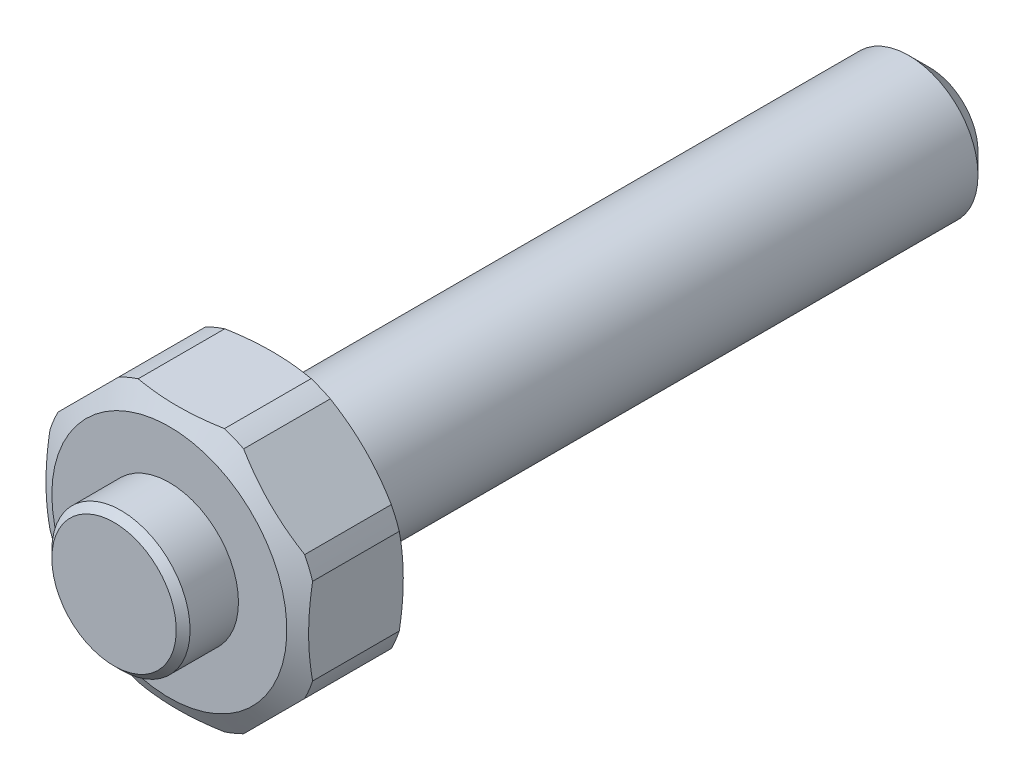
ISO-10303-21;
HEADER;
FILE_DESCRIPTION(('STEP AP214'),'2;1');
FILE_NAME('part.step','',(''),(''),'','','');
FILE_SCHEMA(('AUTOMOTIVE_DESIGN { 1 0 10303 214 1 1 1 1 }'));
ENDSEC;
DATA;
#1=APPLICATION_CONTEXT('core data for automotive mechanical design processes');
#2=APPLICATION_PROTOCOL_DEFINITION('international standard','automotive_design',2000,#1);
#3=PRODUCT_CONTEXT('',#1,'mechanical');
#4=PRODUCT('Part','Part','',(#3));
#5=PRODUCT_RELATED_PRODUCT_CATEGORY('part','',(#4));
#6=PRODUCT_DEFINITION_FORMATION('','',#4);
#7=PRODUCT_DEFINITION_CONTEXT('part definition',#1,'design');
#8=PRODUCT_DEFINITION('design','',#6,#7);
#9=PRODUCT_DEFINITION_SHAPE('','',#8);
#10=(LENGTH_UNIT() NAMED_UNIT(*) SI_UNIT(.MILLI.,.METRE.));
#11=(NAMED_UNIT(*) PLANE_ANGLE_UNIT() SI_UNIT($,.RADIAN.));
#12=(NAMED_UNIT(*) SI_UNIT($,.STERADIAN.) SOLID_ANGLE_UNIT());
#13=UNCERTAINTY_MEASURE_WITH_UNIT(LENGTH_MEASURE(1.E-05),#10,'distance_accuracy_value','');
#14=(GEOMETRIC_REPRESENTATION_CONTEXT(3) GLOBAL_UNCERTAINTY_ASSIGNED_CONTEXT((#13)) GLOBAL_UNIT_ASSIGNED_CONTEXT((#10,
#11,#12)) REPRESENTATION_CONTEXT('',''));
#15=CARTESIAN_POINT('',(0.,0.,0.));
#16=DIRECTION('',(0.,0.,1.));
#17=DIRECTION('',(1.,0.,0.));
#18=AXIS2_PLACEMENT_3D('',#15,#16,#17);
#19=CARTESIAN_POINT('',(5.,0.,0.));
#20=DIRECTION('',(0.,0.,1.));
#21=DIRECTION('',(1.,0.,0.));
#22=AXIS2_PLACEMENT_3D('',#19,#20,#21);
#23=PLANE('',#22);
#24=CARTESIAN_POINT('',(0.,0.,0.));
#25=DIRECTION('',(0.,0.,1.));
#26=DIRECTION('',(1.,0.,0.));
#27=AXIS2_PLACEMENT_3D('',#24,#25,#26);
#28=CIRCLE('',#27,5.);
#29=CARTESIAN_POINT('',(5.,0.,0.));
#30=VERTEX_POINT('',#29);
#31=EDGE_CURVE('E351',#30,#30,#28,.T.);
#32=ORIENTED_EDGE('',*,*,#31,.T.);
#33=EDGE_LOOP('',(#32));
#34=FACE_BOUND('',#33,.T.);
#35=CARTESIAN_POINT('',(0.,0.,0.));
#36=DIRECTION('',(0.,0.,-1.));
#37=DIRECTION('',(-1.,0.,0.));
#38=AXIS2_PLACEMENT_3D('',#35,#36,#37);
#39=CIRCLE('',#38,8.5);
#40=CARTESIAN_POINT('',(-8.5,0.,0.));
#41=VERTEX_POINT('',#40);
#42=EDGE_CURVE('E385',#41,#41,#39,.T.);
#43=ORIENTED_EDGE('',*,*,#42,.T.);
#44=EDGE_LOOP('',(#43));
#45=FACE_BOUND('',#44,.T.);
#46=ADVANCED_FACE('F14',(#34,#45),#23,.F.);
#47=CARTESIAN_POINT('',(0.,0.,-47.));
#48=DIRECTION('',(0.,0.,1.));
#49=DIRECTION('',(1.,0.,0.));
#50=AXIS2_PLACEMENT_3D('',#47,#48,#49);
#51=PLANE('',#50);
#52=CARTESIAN_POINT('',(0.,0.,-47.));
#53=DIRECTION('',(0.,0.,1.));
#54=DIRECTION('',(1.,0.,0.));
#55=AXIS2_PLACEMENT_3D('',#52,#53,#54);
#56=CIRCLE('',#55,3.5);
#57=CARTESIAN_POINT('',(3.5,0.,-47.));
#58=VERTEX_POINT('',#57);
#59=EDGE_CURVE('E360',#58,#58,#56,.F.);
#60=ORIENTED_EDGE('',*,*,#59,.T.);
#61=EDGE_LOOP('',(#60));
#62=FACE_BOUND('',#61,.T.);
#63=ADVANCED_FACE('F316',(#62),#51,.F.);
#64=CARTESIAN_POINT('',(0.,0.,33.));
#65=DIRECTION('',(0.,0.,1.));
#66=DIRECTION('',(1.,0.,0.));
#67=AXIS2_PLACEMENT_3D('',#64,#65,#66);
#68=CYLINDRICAL_SURFACE('',#67,5.);
#69=CARTESIAN_POINT('',(0.,0.,-45.5));
#70=DIRECTION('',(0.,0.,1.));
#71=DIRECTION('',(1.,0.,0.));
#72=AXIS2_PLACEMENT_3D('',#69,#70,#71);
#73=CIRCLE('',#72,5.);
#74=CARTESIAN_POINT('',(5.,0.,-45.5));
#75=VERTEX_POINT('',#74);
#76=EDGE_CURVE('E353',#75,#75,#73,.T.);
#77=ORIENTED_EDGE('',*,*,#76,.T.);
#78=EDGE_LOOP('',(#77));
#79=FACE_BOUND('',#78,.T.);
#80=ORIENTED_EDGE('',*,*,#31,.F.);
#81=EDGE_LOOP('',(#80));
#82=FACE_BOUND('',#81,.T.);
#83=ADVANCED_FACE('F323',(#79,#82),#68,.T.);
#84=CARTESIAN_POINT('',(0.,0.,-45.5));
#85=DIRECTION('',(0.,0.,1.));
#86=DIRECTION('',(1.,0.,0.));
#87=AXIS2_PLACEMENT_3D('',#84,#85,#86);
#88=CONICAL_SURFACE('',#87,5.,0.785398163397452);
#89=ORIENTED_EDGE('',*,*,#59,.F.);
#90=EDGE_LOOP('',(#89));
#91=FACE_BOUND('',#90,.T.);
#92=ORIENTED_EDGE('',*,*,#76,.F.);
#93=EDGE_LOOP('',(#92));
#94=FACE_BOUND('',#93,.T.);
#95=ADVANCED_FACE('F16',(#91,#94),#88,.T.);
#96=CARTESIAN_POINT('',(0.,0.,-47.));
#97=DIRECTION('',(0.,0.,-1.));
#98=DIRECTION('',(-1.,0.,0.));
#99=AXIS2_PLACEMENT_3D('',#96,#97,#98);
#100=CYLINDRICAL_SURFACE('',#99,10.);
#101=CARTESIAN_POINT('',(0.,0.,7.1339745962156));
#102=DIRECTION('',(0.,0.,-1.));
#103=DIRECTION('',(-1.,0.,0.));
#104=AXIS2_PLACEMENT_3D('',#101,#102,#103);
#105=CIRCLE('',#104,10.);
#106=CARTESIAN_POINT('',(4.50957420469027,-8.92545463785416,7.1339745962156));
#107=VERTEX_POINT('',#106);
#108=CARTESIAN_POINT('',(3.12249899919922,-9.5,7.1339745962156));
#109=VERTEX_POINT('',#108);
#110=EDGE_CURVE('E378',#107,#109,#105,.T.);
#111=ORIENTED_EDGE('',*,*,#110,.T.);
#112=DIRECTION('',(0.,0.,-1.));
#113=VECTOR('',#112,1.);
#114=CARTESIAN_POINT('',(3.12249899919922,-9.5,-47.));
#115=LINE('',#114,#113);
#116=CARTESIAN_POINT('',(3.12249899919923,-9.5,0.866025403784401));
#117=VERTEX_POINT('',#116);
#118=EDGE_CURVE('E9',#109,#117,#115,.T.);
#119=ORIENTED_EDGE('',*,*,#118,.T.);
#120=CARTESIAN_POINT('',(0.,0.,0.866025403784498));
#121=DIRECTION('',(0.,0.,1.));
#122=DIRECTION('',(1.,0.,0.));
#123=AXIS2_PLACEMENT_3D('',#120,#121,#122);
#124=CIRCLE('',#123,10.);
#125=CARTESIAN_POINT('',(4.50957420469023,-8.92545463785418,0.866025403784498));
#126=VERTEX_POINT('',#125);
#127=EDGE_CURVE('E384',#126,#117,#124,.F.);
#128=ORIENTED_EDGE('',*,*,#127,.F.);
#129=DIRECTION('',(0.,0.,-1.));
#130=VECTOR('',#129,1.);
#131=CARTESIAN_POINT('',(4.50957420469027,-8.92545463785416,-47.));
#132=LINE('',#131,#130);
#133=EDGE_CURVE('E401',#107,#126,#132,.T.);
#134=ORIENTED_EDGE('',*,*,#133,.F.);
#135=EDGE_LOOP('',(#111,#119,#128,#134));
#136=FACE_BOUND('',#135,.T.);
#137=ADVANCED_FACE('F188',(#136),#100,.T.);
#138=CARTESIAN_POINT('',(9.5,-3.12249899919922,0.866025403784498));
#139=VERTEX_POINT('',#138);
#140=CARTESIAN_POINT('',(8.92545463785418,-4.50957420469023,0.866025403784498));
#141=VERTEX_POINT('',#140);
#142=EDGE_CURVE('E29',#139,#141,#124,.F.);
#143=ORIENTED_EDGE('',*,*,#142,.F.);
#144=DIRECTION('',(0.,0.,-1.));
#145=VECTOR('',#144,1.);
#146=CARTESIAN_POINT('',(9.5,-3.12249899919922,-47.));
#147=LINE('',#146,#145);
#148=CARTESIAN_POINT('',(9.5,-3.12249899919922,7.1339745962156));
#149=VERTEX_POINT('',#148);
#150=EDGE_CURVE('E442',#149,#139,#147,.T.);
#151=ORIENTED_EDGE('',*,*,#150,.F.);
#152=CARTESIAN_POINT('',(8.92545463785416,-4.50957420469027,7.1339745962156));
#153=VERTEX_POINT('',#152);
#154=EDGE_CURVE('E403',#149,#153,#105,.T.);
#155=ORIENTED_EDGE('',*,*,#154,.T.);
#156=DIRECTION('',(0.,0.,-1.));
#157=VECTOR('',#156,1.);
#158=CARTESIAN_POINT('',(8.92545463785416,-4.50957420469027,-47.));
#159=LINE('',#158,#157);
#160=EDGE_CURVE('E445',#141,#153,#159,.F.);
#161=ORIENTED_EDGE('',*,*,#160,.F.);
#162=EDGE_LOOP('',(#143,#151,#155,#161));
#163=FACE_BOUND('',#162,.T.);
#164=ADVANCED_FACE('F546',(#163),#100,.T.);
#165=CARTESIAN_POINT('',(8.92545463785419,4.50957420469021,0.866025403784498));
#166=VERTEX_POINT('',#165);
#167=CARTESIAN_POINT('',(9.5,3.12249899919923,0.866025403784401));
#168=VERTEX_POINT('',#167);
#169=EDGE_CURVE('E35',#166,#168,#124,.F.);
#170=ORIENTED_EDGE('',*,*,#169,.F.);
#171=DIRECTION('',(0.,0.,-1.));
#172=VECTOR('',#171,1.);
#173=CARTESIAN_POINT('',(8.92545463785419,4.50957420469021,-47.));
#174=LINE('',#173,#172);
#175=CARTESIAN_POINT('',(8.92545463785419,4.50957420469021,7.1339745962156));
#176=VERTEX_POINT('',#175);
#177=EDGE_CURVE('E437',#176,#166,#174,.T.);
#178=ORIENTED_EDGE('',*,*,#177,.F.);
#179=CARTESIAN_POINT('',(9.5,3.12249899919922,7.1339745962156));
#180=VERTEX_POINT('',#179);
#181=EDGE_CURVE('E405',#176,#180,#105,.T.);
#182=ORIENTED_EDGE('',*,*,#181,.T.);
#183=DIRECTION('',(0.,0.,-1.));
#184=VECTOR('',#183,1.);
#185=CARTESIAN_POINT('',(9.5,3.12249899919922,-47.));
#186=LINE('',#185,#184);
#187=EDGE_CURVE('E440',#168,#180,#186,.F.);
#188=ORIENTED_EDGE('',*,*,#187,.F.);
#189=EDGE_LOOP('',(#170,#178,#182,#188));
#190=FACE_BOUND('',#189,.T.);
#191=ADVANCED_FACE('F553',(#190),#100,.T.);
#192=CARTESIAN_POINT('',(3.12249899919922,9.5,0.866025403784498));
#193=VERTEX_POINT('',#192);
#194=CARTESIAN_POINT('',(4.50957420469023,8.92545463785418,0.866025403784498));
#195=VERTEX_POINT('',#194);
#196=EDGE_CURVE('E388',#193,#195,#124,.F.);
#197=ORIENTED_EDGE('',*,*,#196,.F.);
#198=DIRECTION('',(0.,0.,-1.));
#199=VECTOR('',#198,1.);
#200=CARTESIAN_POINT('',(3.12249899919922,9.5,-47.));
#201=LINE('',#200,#199);
#202=CARTESIAN_POINT('',(3.12249899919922,9.5,7.1339745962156));
#203=VERTEX_POINT('',#202);
#204=EDGE_CURVE('E428',#203,#193,#201,.T.);
#205=ORIENTED_EDGE('',*,*,#204,.F.);
#206=CARTESIAN_POINT('',(4.50957420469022,8.92545463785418,7.1339745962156));
#207=VERTEX_POINT('',#206);
#208=EDGE_CURVE('E410',#203,#207,#105,.T.);
#209=ORIENTED_EDGE('',*,*,#208,.T.);
#210=DIRECTION('',(0.,0.,-1.));
#211=VECTOR('',#210,1.);
#212=CARTESIAN_POINT('',(4.50957420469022,8.92545463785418,-47.));
#213=LINE('',#212,#211);
#214=EDGE_CURVE('E430',#195,#207,#213,.F.);
#215=ORIENTED_EDGE('',*,*,#214,.F.);
#216=EDGE_LOOP('',(#197,#205,#209,#215));
#217=FACE_BOUND('',#216,.T.);
#218=ADVANCED_FACE('F560',(#217),#100,.T.);
#219=CARTESIAN_POINT('',(-4.5095742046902,8.92545463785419,0.866025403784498));
#220=VERTEX_POINT('',#219);
#221=CARTESIAN_POINT('',(-3.12249899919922,9.5,0.866025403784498));
#222=VERTEX_POINT('',#221);
#223=EDGE_CURVE('E389',#220,#222,#124,.F.);
#224=ORIENTED_EDGE('',*,*,#223,.F.);
#225=DIRECTION('',(0.,0.,-1.));
#226=VECTOR('',#225,1.);
#227=CARTESIAN_POINT('',(-4.5095742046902,8.92545463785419,-47.));
#228=LINE('',#227,#226);
#229=CARTESIAN_POINT('',(-4.5095742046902,8.92545463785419,7.1339745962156));
#230=VERTEX_POINT('',#229);
#231=EDGE_CURVE('E425',#230,#220,#228,.T.);
#232=ORIENTED_EDGE('',*,*,#231,.F.);
#233=CARTESIAN_POINT('',(-3.12249899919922,9.5,7.1339745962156));
#234=VERTEX_POINT('',#233);
#235=EDGE_CURVE('E150',#230,#234,#105,.T.);
#236=ORIENTED_EDGE('',*,*,#235,.T.);
#237=DIRECTION('',(0.,0.,-1.));
#238=VECTOR('',#237,1.);
#239=CARTESIAN_POINT('',(-3.12249899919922,9.5,-47.));
#240=LINE('',#239,#238);
#241=EDGE_CURVE('E422',#222,#234,#240,.F.);
#242=ORIENTED_EDGE('',*,*,#241,.F.);
#243=EDGE_LOOP('',(#224,#232,#236,#242));
#244=FACE_BOUND('',#243,.T.);
#245=ADVANCED_FACE('F421',(#244),#100,.T.);
#246=DIRECTION('',(0.,0.,-1.));
#247=VECTOR('',#246,1.);
#248=CARTESIAN_POINT('',(-9.5,-3.12249899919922,-47.));
#249=LINE('',#248,#247);
#250=CARTESIAN_POINT('',(-9.5,-3.12249899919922,7.1339745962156));
#251=VERTEX_POINT('',#250);
#252=CARTESIAN_POINT('',(-9.5,-3.12249899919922,0.866025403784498));
#253=VERTEX_POINT('',#252);
#254=EDGE_CURVE('E137',#251,#253,#249,.T.);
#255=ORIENTED_EDGE('',*,*,#254,.T.);
#256=CARTESIAN_POINT('',(-8.92545463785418,-4.50957420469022,0.866025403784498));
#257=VERTEX_POINT('',#256);
#258=EDGE_CURVE('E394',#257,#253,#124,.F.);
#259=ORIENTED_EDGE('',*,*,#258,.F.);
#260=DIRECTION('',(0.,0.,-1.));
#261=VECTOR('',#260,1.);
#262=CARTESIAN_POINT('',(-8.92545463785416,-4.50957420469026,-47.));
#263=LINE('',#262,#261);
#264=CARTESIAN_POINT('',(-8.92545463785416,-4.50957420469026,7.1339745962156));
#265=VERTEX_POINT('',#264);
#266=EDGE_CURVE('E630',#257,#265,#263,.F.);
#267=ORIENTED_EDGE('',*,*,#266,.T.);
#268=EDGE_CURVE('E152',#265,#251,#105,.T.);
#269=ORIENTED_EDGE('',*,*,#268,.T.);
#270=EDGE_LOOP('',(#255,#259,#267,#269));
#271=FACE_BOUND('',#270,.T.);
#272=ADVANCED_FACE('F573',(#271),#100,.T.);
#273=CARTESIAN_POINT('',(-9.5,3.12249899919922,0.866025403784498));
#274=VERTEX_POINT('',#273);
#275=CARTESIAN_POINT('',(-8.92545463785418,4.50957420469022,0.866025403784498));
#276=VERTEX_POINT('',#275);
#277=EDGE_CURVE('E133',#274,#276,#124,.F.);
#278=ORIENTED_EDGE('',*,*,#277,.F.);
#279=DIRECTION('',(0.,0.,-1.));
#280=VECTOR('',#279,1.);
#281=CARTESIAN_POINT('',(-9.5,3.12249899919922,-47.));
#282=LINE('',#281,#280);
#283=CARTESIAN_POINT('',(-9.5,3.12249899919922,7.1339745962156));
#284=VERTEX_POINT('',#283);
#285=EDGE_CURVE('E127',#274,#284,#282,.F.);
#286=ORIENTED_EDGE('',*,*,#285,.T.);
#287=CARTESIAN_POINT('',(-8.92545463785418,4.50957420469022,7.1339745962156));
#288=VERTEX_POINT('',#287);
#289=EDGE_CURVE('E131',#284,#288,#105,.T.);
#290=ORIENTED_EDGE('',*,*,#289,.T.);
#291=DIRECTION('',(0.,0.,-1.));
#292=VECTOR('',#291,1.);
#293=CARTESIAN_POINT('',(-8.92545463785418,4.50957420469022,-47.));
#294=LINE('',#293,#292);
#295=EDGE_CURVE('E432',#276,#288,#294,.F.);
#296=ORIENTED_EDGE('',*,*,#295,.F.);
#297=EDGE_LOOP('',(#278,#286,#290,#296));
#298=FACE_BOUND('',#297,.T.);
#299=ADVANCED_FACE('F129',(#298),#100,.T.);
#300=DIRECTION('',(0.,0.,-1.));
#301=VECTOR('',#300,1.);
#302=CARTESIAN_POINT('',(-4.50957420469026,-8.92545463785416,-47.));
#303=LINE('',#302,#301);
#304=CARTESIAN_POINT('',(-4.50957420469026,-8.92545463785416,7.1339745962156));
#305=VERTEX_POINT('',#304);
#306=CARTESIAN_POINT('',(-4.50957420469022,-8.92545463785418,0.866025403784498));
#307=VERTEX_POINT('',#306);
#308=EDGE_CURVE('E138',#305,#307,#303,.T.);
#309=ORIENTED_EDGE('',*,*,#308,.T.);
#310=CARTESIAN_POINT('',(-3.12249899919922,-9.5,0.866025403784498));
#311=VERTEX_POINT('',#310);
#312=EDGE_CURVE('E374',#311,#307,#124,.F.);
#313=ORIENTED_EDGE('',*,*,#312,.F.);
#314=DIRECTION('',(0.,0.,-1.));
#315=VECTOR('',#314,1.);
#316=CARTESIAN_POINT('',(-3.12249899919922,-9.5,-47.));
#317=LINE('',#316,#315);
#318=CARTESIAN_POINT('',(-3.12249899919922,-9.5,7.1339745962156));
#319=VERTEX_POINT('',#318);
#320=EDGE_CURVE('E22',#311,#319,#317,.F.);
#321=ORIENTED_EDGE('',*,*,#320,.T.);
#322=EDGE_CURVE('E372',#319,#305,#105,.T.);
#323=ORIENTED_EDGE('',*,*,#322,.T.);
#324=EDGE_LOOP('',(#309,#313,#321,#323));
#325=FACE_BOUND('',#324,.T.);
#326=ADVANCED_FACE('F262',(#325),#100,.T.);
#327=CARTESIAN_POINT('',(0.,0.,1.2519735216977));
#328=DIRECTION('',(0.,0.,1.));
#329=DIRECTION('',(1.,0.,0.));
#330=AXIS2_PLACEMENT_3D('',#327,#328,#329);
#331=CONICAL_SURFACE('',#330,10.6684817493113,1.0471975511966);
#332=CARTESIAN_POINT('',(8.92623897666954,-4.50878986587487,0.866225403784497));
#333=CARTESIAN_POINT('',(8.76725039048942,-4.66777845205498,0.82565943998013));
#334=CARTESIAN_POINT('',(8.60775417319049,-4.82727466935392,0.788950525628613));
#335=CARTESIAN_POINT('',(8.28788818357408,-5.14714065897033,0.723814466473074));
#336=CARTESIAN_POINT('',(8.12751824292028,-5.30751059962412,0.695388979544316));
#337=CARTESIAN_POINT('',(7.80607824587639,-5.62895059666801,0.647399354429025));
#338=CARTESIAN_POINT('',(7.64500805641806,-5.79002078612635,0.627836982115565));
#339=CARTESIAN_POINT('',(7.32244893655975,-6.11257990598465,0.59799150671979));
#340=CARTESIAN_POINT('',(7.16096004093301,-6.2740688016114,0.587707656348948));
#341=CARTESIAN_POINT('',(6.84003571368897,-6.59499312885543,0.576721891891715));
#342=CARTESIAN_POINT('',(6.68060250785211,-6.75442633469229,0.575890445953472));
#343=CARTESIAN_POINT('',(6.3618464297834,-7.073182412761,0.583492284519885));
#344=CARTESIAN_POINT('',(6.20252355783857,-7.23250528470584,0.591925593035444));
#345=CARTESIAN_POINT('',(5.88433570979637,-7.55069313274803,0.617866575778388));
#346=CARTESIAN_POINT('',(5.72547053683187,-7.70955830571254,0.635369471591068));
#347=CARTESIAN_POINT('',(5.40835671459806,-8.02667212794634,0.679082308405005));
#348=CARTESIAN_POINT('',(5.25010799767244,-8.18492084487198,0.705291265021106));
#349=CARTESIAN_POINT('',(5.0435304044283,-8.39149843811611,0.744954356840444));
#350=CARTESIAN_POINT('',(4.99483434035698,-8.44019450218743,0.754702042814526));
#351=CARTESIAN_POINT('',(4.89752615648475,-8.53750268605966,0.774960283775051));
#352=CARTESIAN_POINT('',(4.84891402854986,-8.58611481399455,0.785470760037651));
#353=CARTESIAN_POINT('',(4.75166725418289,-8.68336158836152,0.807261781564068));
#354=CARTESIAN_POINT('',(4.70303279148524,-8.73199605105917,0.818543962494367));
#355=CARTESIAN_POINT('',(4.60584700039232,-8.82918184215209,0.841840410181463));
#356=CARTESIAN_POINT('',(4.55729568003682,-8.87773316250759,0.853854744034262));
#357=CARTESIAN_POINT('',(4.50878986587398,-8.92623897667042,0.866225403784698));
#358=B_SPLINE_CURVE_WITH_KNOTS('',3,(#332,#333,#334,#335,#336,#337,#338,#339,#340,#341,#342,
#343,#344,#345,#346,#347,#348,#349,#350,#351,#352,#353,#354,#355,#356,#357),.UNSPECIFIED.,.F.,
.F.,(4,2,2,2,2,2,2,2,2,2,2,2,4),(0.,0.685420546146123,1.37097818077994,2.05667234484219,
2.74231127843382,3.41854298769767,4.09477644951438,4.77065399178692,5.44645513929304,
5.65511208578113,5.86374752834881,6.07283977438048,6.28195121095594),.UNSPECIFIED.);
#359=EDGE_CURVE('E248',#141,#126,#358,.T.);
#360=ORIENTED_EDGE('',*,*,#359,.T.);
#361=ORIENTED_EDGE('',*,*,#127,.T.);
#362=CARTESIAN_POINT('',(-11.7991337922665,-9.5,3.8383704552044));
#363=CARTESIAN_POINT('',(-11.6196197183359,-9.5,3.75764424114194));
#364=CARTESIAN_POINT('',(-11.4398364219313,-9.5,3.67751717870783));
#365=CARTESIAN_POINT('',(-11.0796807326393,-9.5,3.5185898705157));
#366=CARTESIAN_POINT('',(-10.8993083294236,-9.5,3.43978964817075));
#367=CARTESIAN_POINT('',(-10.3571587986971,-9.5,3.20554074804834));
#368=CARTESIAN_POINT('',(-9.99443096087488,-9.5,3.05228067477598));
#369=CARTESIAN_POINT('',(-9.26387410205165,-9.5,2.75200834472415));
#370=CARTESIAN_POINT('',(-8.89602758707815,-9.5,2.60503851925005));
#371=CARTESIAN_POINT('',(-8.15690987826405,-9.5,2.32000550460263));
#372=CARTESIAN_POINT('',(-7.78563890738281,-9.5,2.18194174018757));
#373=CARTESIAN_POINT('',(-7.04316993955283,-9.5,1.91824605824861));
#374=CARTESIAN_POINT('',(-6.67201393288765,-9.5,1.79249660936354));
#375=CARTESIAN_POINT('',(-5.9253925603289,-9.5,1.55429452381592));
#376=CARTESIAN_POINT('',(-5.54992687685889,-9.5,1.441842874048));
#377=CARTESIAN_POINT('',(-4.79528025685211,-9.5,1.23350959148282));
#378=CARTESIAN_POINT('',(-4.41610937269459,-9.5,1.13759186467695));
#379=CARTESIAN_POINT('',(-3.65333357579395,-9.5,0.965449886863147));
#380=CARTESIAN_POINT('',(-3.26972975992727,-9.5,0.889220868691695));
#381=CARTESIAN_POINT('',(-2.66208882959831,-9.5,0.787300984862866));
#382=CARTESIAN_POINT('',(-2.43933466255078,-9.5,0.753884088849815));
#383=CARTESIAN_POINT('',(-1.99274850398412,-9.5,0.695313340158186));
#384=CARTESIAN_POINT('',(-1.76891659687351,-9.5,0.670158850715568));
#385=CARTESIAN_POINT('',(-1.32040221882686,-9.5,0.628600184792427));
#386=CARTESIAN_POINT('',(-1.09571961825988,-9.5,0.612197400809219));
#387=CARTESIAN_POINT('',(-0.645869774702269,-9.5,0.588490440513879));
#388=CARTESIAN_POINT('',(-0.420702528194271,-9.5,0.581186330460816));
#389=CARTESIAN_POINT('',(0.0299682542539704,-9.5,0.575833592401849));
#390=CARTESIAN_POINT('',(0.255471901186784,-9.5,0.577794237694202));
#391=CARTESIAN_POINT('',(0.706205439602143,-9.5,0.590948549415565));
#392=CARTESIAN_POINT('',(0.931435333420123,-9.5,0.602142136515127));
#393=CARTESIAN_POINT('',(1.38119404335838,-9.5,0.633517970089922));
#394=CARTESIAN_POINT('',(1.60572305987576,-9.5,0.653697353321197));
#395=CARTESIAN_POINT('',(2.05385286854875,-9.5,0.702628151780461));
#396=CARTESIAN_POINT('',(2.27745357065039,-9.5,0.731380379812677));
#397=CARTESIAN_POINT('',(2.97093135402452,-9.5,0.833304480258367));
#398=CARTESIAN_POINT('',(3.43880776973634,-9.5,0.920366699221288));
#399=CARTESIAN_POINT('',(4.36807181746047,-9.5,1.12423701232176));
#400=CARTESIAN_POINT('',(4.82945621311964,-9.5,1.24105942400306));
#401=CARTESIAN_POINT('',(5.74730092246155,-9.5,1.49876979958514));
#402=CARTESIAN_POINT('',(6.20373520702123,-9.5,1.63974931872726));
#403=CARTESIAN_POINT('',(7.11035554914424,-9.5,1.94013357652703));
#404=CARTESIAN_POINT('',(7.56054247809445,-9.5,2.09953571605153));
#405=CARTESIAN_POINT('',(8.46087603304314,-9.5,2.43456119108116));
#406=CARTESIAN_POINT('',(8.91095899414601,-9.5,2.61035433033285));
#407=CARTESIAN_POINT('',(9.80656288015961,-9.5,2.97323675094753));
#408=CARTESIAN_POINT('',(10.2520834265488,-9.5,3.16032696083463));
#409=CARTESIAN_POINT('',(11.1349942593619,-9.5,3.54144819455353));
#410=CARTESIAN_POINT('',(11.5724214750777,-9.5,3.73539398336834));
#411=CARTESIAN_POINT('',(12.2261672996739,-9.5,4.03140711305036));
#412=CARTESIAN_POINT('',(12.4436522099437,-9.5,4.1309125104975));
#413=CARTESIAN_POINT('',(12.8779098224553,-9.5,4.33145496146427));
#414=CARTESIAN_POINT('',(13.0946825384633,-9.5,4.43249198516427));
#415=CARTESIAN_POINT('',(13.3111357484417,-9.5,4.5342092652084));
#416=B_SPLINE_CURVE_WITH_KNOTS('',3,(#362,#363,#364,#365,#366,#367,#368,#369,#370,#371,#372,
#373,#374,#375,#376,#377,#378,#379,#380,#381,#382,#383,#384,#385,#386,#387,#388,#389,#390,#391,
#392,#393,#394,#395,#396,#397,#398,#399,#400,#401,#402,#403,#404,#405,#406,#407,#408,#409,#410,
#411,#412,#413,#414,#415),.UNSPECIFIED.,.F.,.F.,(4,2,2,2,2,2,2,2,2,2,2,2,2,2,2,2,2,2,2,2,2,2,2,
2,2,2,4),(0.,0.590487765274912,1.18098593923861,2.3622508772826,3.5505196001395,
4.73871149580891,5.91414991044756,7.08967550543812,8.26260147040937,9.43524317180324,
10.1108513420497,10.7864074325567,11.4620709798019,12.1377394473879,12.8140843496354,
13.4904234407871,14.1665471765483,14.8427350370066,16.2691371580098,17.6962268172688,
19.1288498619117,20.5612710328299,22.0106625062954,23.4601732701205,24.8955818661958,
25.6130792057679,26.3305625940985),.UNSPECIFIED.);
#417=EDGE_CURVE('E266',#311,#117,#416,.T.);
#418=ORIENTED_EDGE('',*,*,#417,.F.);
#419=ORIENTED_EDGE('',*,*,#312,.T.);
#420=CARTESIAN_POINT('',(-8.92623897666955,-4.50878986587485,0.866225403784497));
#421=CARTESIAN_POINT('',(-8.76725039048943,-4.66777845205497,0.82565943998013));
#422=CARTESIAN_POINT('',(-8.6077541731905,-4.8272746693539,0.788950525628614));
#423=CARTESIAN_POINT('',(-8.28788818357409,-5.14714065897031,0.723814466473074));
#424=CARTESIAN_POINT('',(-8.12751824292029,-5.30751059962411,0.695388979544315));
#425=CARTESIAN_POINT('',(-7.8060782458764,-5.628950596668,0.647399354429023));
#426=CARTESIAN_POINT('',(-7.64500805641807,-5.79002078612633,0.627836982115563));
#427=CARTESIAN_POINT('',(-7.32244893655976,-6.11257990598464,0.597991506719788));
#428=CARTESIAN_POINT('',(-7.16096004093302,-6.27406880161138,0.587707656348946));
#429=CARTESIAN_POINT('',(-6.84003571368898,-6.59499312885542,0.576721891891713));
#430=CARTESIAN_POINT('',(-6.68060250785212,-6.75442633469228,0.57589044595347));
#431=CARTESIAN_POINT('',(-6.36184642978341,-7.07318241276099,0.583492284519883));
#432=CARTESIAN_POINT('',(-6.20252355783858,-7.23250528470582,0.591925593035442));
#433=CARTESIAN_POINT('',(-5.88433570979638,-7.55069313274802,0.617866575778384));
#434=CARTESIAN_POINT('',(-5.72547053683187,-7.70955830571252,0.635369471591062));
#435=CARTESIAN_POINT('',(-5.40835671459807,-8.02667212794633,0.679082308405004));
#436=CARTESIAN_POINT('',(-5.25010799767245,-8.18492084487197,0.70529126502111));
#437=CARTESIAN_POINT('',(-5.04353040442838,-8.39149843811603,0.744954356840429));
#438=CARTESIAN_POINT('',(-4.99483434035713,-8.44019450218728,0.754702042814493));
#439=CARTESIAN_POINT('',(-4.89752615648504,-8.53750268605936,0.774960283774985));
#440=CARTESIAN_POINT('',(-4.84891402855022,-8.58611481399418,0.785470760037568));
#441=CARTESIAN_POINT('',(-4.75166725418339,-8.683361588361,0.807261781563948));
#442=CARTESIAN_POINT('',(-4.70303279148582,-8.73199605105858,0.818543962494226));
#443=CARTESIAN_POINT('',(-4.60584700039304,-8.82918184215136,0.841840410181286));
#444=CARTESIAN_POINT('',(-4.55729568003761,-8.87773316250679,0.853854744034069));
#445=CARTESIAN_POINT('',(-4.50878986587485,-8.92623897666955,0.866225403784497));
#446=B_SPLINE_CURVE_WITH_KNOTS('',3,(#420,#421,#422,#423,#424,#425,#426,#427,#428,#429,#430,
#431,#432,#433,#434,#435,#436,#437,#438,#439,#440,#441,#442,#443,#444,#445),.UNSPECIFIED.,.F.,
.F.,(4,2,2,2,2,2,2,2,2,2,2,2,4),(0.,0.685420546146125,1.37097818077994,2.05667234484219,
2.74231127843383,3.41854298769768,4.09477644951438,4.77065399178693,5.44645513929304,
5.65511208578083,5.8637475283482,6.07283977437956,6.28195121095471),.UNSPECIFIED.);
#447=EDGE_CURVE('E274',#257,#307,#446,.T.);
#448=ORIENTED_EDGE('',*,*,#447,.F.);
#449=ORIENTED_EDGE('',*,*,#258,.T.);
#450=CARTESIAN_POINT('',(-9.5,-11.7991337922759,3.8383704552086));
#451=CARTESIAN_POINT('',(-9.5,-11.6196197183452,3.75764424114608));
#452=CARTESIAN_POINT('',(-9.50000000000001,-11.4398364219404,3.67751717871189));
#453=CARTESIAN_POINT('',(-9.50000000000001,-11.0796807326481,3.51858987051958));
#454=CARTESIAN_POINT('',(-9.50000000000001,-10.8993083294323,3.43978964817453));
#455=CARTESIAN_POINT('',(-9.50000000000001,-10.3571587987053,3.20554074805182));
#456=CARTESIAN_POINT('',(-9.50000000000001,-9.99443096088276,3.05228067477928));
#457=CARTESIAN_POINT('',(-9.50000000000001,-9.26387410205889,2.75200834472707));
#458=CARTESIAN_POINT('',(-9.50000000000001,-8.89602758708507,2.60503851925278));
#459=CARTESIAN_POINT('',(-9.50000000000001,-8.15690987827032,2.32000550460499));
#460=CARTESIAN_POINT('',(-9.50000000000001,-7.78563890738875,2.18194174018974));
#461=CARTESIAN_POINT('',(-9.50000000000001,-7.04316993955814,1.91824605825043));
#462=CARTESIAN_POINT('',(-9.50000000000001,-6.67201393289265,1.7924966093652));
#463=CARTESIAN_POINT('',(-9.50000000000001,-5.92539256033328,1.55429452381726));
#464=CARTESIAN_POINT('',(-9.5,-5.54992687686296,1.44184287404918));
#465=CARTESIAN_POINT('',(-9.5,-4.79528025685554,1.23350959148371));
#466=CARTESIAN_POINT('',(-9.50000000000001,-4.41610937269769,1.13759186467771));
#467=CARTESIAN_POINT('',(-9.5,-3.6533335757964,0.965449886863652));
#468=CARTESIAN_POINT('',(-9.5,-3.2697297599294,0.889220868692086));
#469=CARTESIAN_POINT('',(-9.5,-2.66208882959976,0.787300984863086));
#470=CARTESIAN_POINT('',(-9.5,-2.43933466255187,0.753884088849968));
#471=CARTESIAN_POINT('',(-9.5,-1.99274850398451,0.69531334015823));
#472=CARTESIAN_POINT('',(-9.5,-1.76891659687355,0.670158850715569));
#473=CARTESIAN_POINT('',(-9.5,-1.32040221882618,0.628600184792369));
#474=CARTESIAN_POINT('',(-9.5,-1.09571961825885,0.612197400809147));
#475=CARTESIAN_POINT('',(-9.5,-0.645869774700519,0.588490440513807));
#476=CARTESIAN_POINT('',(-9.5,-0.420702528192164,0.581186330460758));
#477=CARTESIAN_POINT('',(-9.5,0.0299682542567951,0.575833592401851));
#478=CARTESIAN_POINT('',(-9.5,0.255471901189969,0.577794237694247));
#479=CARTESIAN_POINT('',(-9.5,0.706205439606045,0.590948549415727));
#480=CARTESIAN_POINT('',(-9.5,0.931435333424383,0.602142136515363));
#481=CARTESIAN_POINT('',(-9.5,1.38119404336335,0.63351797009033));
#482=CARTESIAN_POINT('',(-9.5,1.60572305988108,0.653697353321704));
#483=CARTESIAN_POINT('',(-9.5,2.05385286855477,0.702628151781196));
#484=CARTESIAN_POINT('',(-9.5,2.27745357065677,0.731380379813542));
#485=CARTESIAN_POINT('',(-9.5,2.97093135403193,0.833304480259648));
#486=CARTESIAN_POINT('',(-9.5,3.43880776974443,0.920366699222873));
#487=CARTESIAN_POINT('',(-9.5,4.3680718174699,1.12423701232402));
#488=CARTESIAN_POINT('',(-9.5,4.82945621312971,1.24105942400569));
#489=CARTESIAN_POINT('',(-9.5,5.74730092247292,1.49876979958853));
#490=CARTESIAN_POINT('',(-9.5,6.20373520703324,1.63974931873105));
#491=CARTESIAN_POINT('',(-9.5,7.11035554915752,1.94013357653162));
#492=CARTESIAN_POINT('',(-9.5,7.56054247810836,2.09953571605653));
#493=CARTESIAN_POINT('',(-9.5,8.46087603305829,2.43456119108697));
#494=CARTESIAN_POINT('',(-9.5,8.91095899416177,2.61035433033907));
#495=CARTESIAN_POINT('',(-9.5,9.8065628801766,2.97323675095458));
#496=CARTESIAN_POINT('',(-9.5,10.2520834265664,3.16032696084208));
#497=CARTESIAN_POINT('',(-9.5,11.1349942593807,3.54144819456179));
#498=CARTESIAN_POINT('',(-9.5,11.5724214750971,3.73539398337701));
#499=CARTESIAN_POINT('',(-9.5,12.2261672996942,4.03140711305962));
#500=CARTESIAN_POINT('',(-9.5,12.4436522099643,4.13091251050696));
#501=CARTESIAN_POINT('',(-9.5,12.8779098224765,4.33145496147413));
#502=CARTESIAN_POINT('',(-9.5,13.0946825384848,4.43249198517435));
#503=CARTESIAN_POINT('',(-9.5,13.3111357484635,4.5342092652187));
#504=B_SPLINE_CURVE_WITH_KNOTS('',3,(#450,#451,#452,#453,#454,#455,#456,#457,#458,#459,#460,
#461,#462,#463,#464,#465,#466,#467,#468,#469,#470,#471,#472,#473,#474,#475,#476,#477,#478,#479,
#480,#481,#482,#483,#484,#485,#486,#487,#488,#489,#490,#491,#492,#493,#494,#495,#496,#497,#498,
#499,#500,#501,#502,#503),.UNSPECIFIED.,.F.,.F.,(4,2,2,2,2,2,2,2,2,2,2,2,2,2,2,2,2,2,2,2,2,2,2,
2,2,2,4),(0.,0.590487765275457,1.1809859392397,2.36225087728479,3.5505196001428,
4.73871149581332,5.91414991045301,7.08967550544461,8.26260147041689,9.43524317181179,
10.1108513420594,10.7864074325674,11.4620709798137,12.1377394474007,12.8140843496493,
13.4904234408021,14.1665471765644,14.8427350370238,16.2691371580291,17.6962268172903,
19.1288498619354,20.5612710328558,22.0106625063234,23.4601732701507,24.8955818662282,
25.6130792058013,26.3305625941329),.UNSPECIFIED.);
#505=EDGE_CURVE('E281',#274,#253,#504,.F.);
#506=ORIENTED_EDGE('',*,*,#505,.F.);
#507=ORIENTED_EDGE('',*,*,#277,.T.);
#508=CARTESIAN_POINT('',(-8.92623897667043,4.50878986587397,0.866225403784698));
#509=CARTESIAN_POINT('',(-8.76725039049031,4.66777845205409,0.825659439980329));
#510=CARTESIAN_POINT('',(-8.60775417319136,4.82727466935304,0.788950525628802));
#511=CARTESIAN_POINT('',(-8.28788818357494,5.14714065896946,0.723814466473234));
#512=CARTESIAN_POINT('',(-8.12751824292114,5.30751059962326,0.695388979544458));
#513=CARTESIAN_POINT('',(-7.80607824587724,5.62895059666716,0.647399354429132));
#514=CARTESIAN_POINT('',(-7.6450080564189,5.79002078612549,0.627836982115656));
#515=CARTESIAN_POINT('',(-7.32244893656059,6.11257990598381,0.597991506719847));
#516=CARTESIAN_POINT('',(-7.16096004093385,6.27406880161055,0.58770765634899));
#517=CARTESIAN_POINT('',(-6.8400357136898,6.5949931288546,0.576721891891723));
#518=CARTESIAN_POINT('',(-6.68060250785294,6.75442633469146,0.575890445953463));
#519=CARTESIAN_POINT('',(-6.36184642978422,7.07318241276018,0.583492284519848));
#520=CARTESIAN_POINT('',(-6.20252355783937,7.23250528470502,0.591925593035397));
#521=CARTESIAN_POINT('',(-5.88433570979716,7.55069313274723,0.617866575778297));
#522=CARTESIAN_POINT('',(-5.72547053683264,7.70955830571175,0.635369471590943));
#523=CARTESIAN_POINT('',(-5.40835671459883,8.02667212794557,0.679082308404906));
#524=CARTESIAN_POINT('',(-5.2501079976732,8.18492084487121,0.705291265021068));
#525=CARTESIAN_POINT('',(-5.04353040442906,8.39149843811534,0.744954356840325));
#526=CARTESIAN_POINT('',(-4.99483434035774,8.44019450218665,0.754702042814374));
#527=CARTESIAN_POINT('',(-4.89752615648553,8.53750268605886,0.774960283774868));
#528=CARTESIAN_POINT('',(-4.84891402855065,8.58611481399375,0.785470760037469));
#529=CARTESIAN_POINT('',(-4.7516672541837,8.6833615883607,0.807261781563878));
#530=CARTESIAN_POINT('',(-4.70303279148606,8.73199605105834,0.818543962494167));
#531=CARTESIAN_POINT('',(-4.60584700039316,8.82918184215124,0.841840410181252));
#532=CARTESIAN_POINT('',(-4.55729568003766,8.87773316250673,0.853854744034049));
#533=CARTESIAN_POINT('',(-4.50878986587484,8.92623897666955,0.866225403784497));
#534=B_SPLINE_CURVE_WITH_KNOTS('',3,(#508,#509,#510,#511,#512,#513,#514,#515,#516,#517,#518,
#519,#520,#521,#522,#523,#524,#525,#526,#527,#528,#529,#530,#531,#532,#533),.UNSPECIFIED.,.F.,
.F.,(4,2,2,2,2,2,2,2,2,2,2,2,4),(0.,0.685420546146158,1.37097818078,2.05667234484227,
2.74231127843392,3.41854298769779,4.09477644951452,4.7706539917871,5.44645513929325,
5.65511208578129,5.86374752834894,6.07283977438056,6.28195121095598),.UNSPECIFIED.);
#535=EDGE_CURVE('E288',#276,#220,#534,.T.);
#536=ORIENTED_EDGE('',*,*,#535,.T.);
#537=ORIENTED_EDGE('',*,*,#223,.T.);
#538=CARTESIAN_POINT('',(-11.7991337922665,9.5,3.8383704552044));
#539=CARTESIAN_POINT('',(-11.6196197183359,9.5,3.75764424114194));
#540=CARTESIAN_POINT('',(-11.4398364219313,9.5,3.67751717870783));
#541=CARTESIAN_POINT('',(-11.0796807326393,9.5,3.5185898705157));
#542=CARTESIAN_POINT('',(-10.8993083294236,9.5,3.43978964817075));
#543=CARTESIAN_POINT('',(-10.3571587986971,9.5,3.20554074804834));
#544=CARTESIAN_POINT('',(-9.99443096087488,9.5,3.05228067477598));
#545=CARTESIAN_POINT('',(-9.26387410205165,9.5,2.75200834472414));
#546=CARTESIAN_POINT('',(-8.89602758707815,9.5,2.60503851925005));
#547=CARTESIAN_POINT('',(-8.15690987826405,9.5,2.32000550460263));
#548=CARTESIAN_POINT('',(-7.78563890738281,9.5,2.18194174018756));
#549=CARTESIAN_POINT('',(-7.04316993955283,9.5,1.91824605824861));
#550=CARTESIAN_POINT('',(-6.67201393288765,9.5,1.79249660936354));
#551=CARTESIAN_POINT('',(-5.9253925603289,9.5,1.55429452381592));
#552=CARTESIAN_POINT('',(-5.54992687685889,9.5,1.441842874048));
#553=CARTESIAN_POINT('',(-4.79528025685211,9.5,1.23350959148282));
#554=CARTESIAN_POINT('',(-4.41610937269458,9.5,1.13759186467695));
#555=CARTESIAN_POINT('',(-3.65333357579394,9.5,0.965449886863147));
#556=CARTESIAN_POINT('',(-3.26972975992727,9.5,0.889220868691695));
#557=CARTESIAN_POINT('',(-2.66208882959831,9.5,0.787300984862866));
#558=CARTESIAN_POINT('',(-2.43933466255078,9.5,0.753884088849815));
#559=CARTESIAN_POINT('',(-1.99274850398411,9.5,0.695313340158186));
#560=CARTESIAN_POINT('',(-1.76891659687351,9.5,0.670158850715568));
#561=CARTESIAN_POINT('',(-1.32040221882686,9.5,0.628600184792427));
#562=CARTESIAN_POINT('',(-1.09571961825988,9.5,0.61219740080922));
#563=CARTESIAN_POINT('',(-0.645869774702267,9.5,0.58849044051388));
#564=CARTESIAN_POINT('',(-0.420702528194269,9.5,0.581186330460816));
#565=CARTESIAN_POINT('',(0.0299682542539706,9.5,0.575833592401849));
#566=CARTESIAN_POINT('',(0.255471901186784,9.5,0.577794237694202));
#567=CARTESIAN_POINT('',(0.706205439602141,9.5,0.590948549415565));
#568=CARTESIAN_POINT('',(0.93143533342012,9.5,0.602142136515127));
#569=CARTESIAN_POINT('',(1.38119404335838,9.5,0.633517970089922));
#570=CARTESIAN_POINT('',(1.60572305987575,9.5,0.653697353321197));
#571=CARTESIAN_POINT('',(2.05385286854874,9.5,0.702628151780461));
#572=CARTESIAN_POINT('',(2.27745357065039,9.5,0.731380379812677));
#573=CARTESIAN_POINT('',(2.97093135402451,9.5,0.833304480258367));
#574=CARTESIAN_POINT('',(3.43880776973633,9.5,0.920366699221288));
#575=CARTESIAN_POINT('',(4.36807181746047,9.5,1.12423701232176));
#576=CARTESIAN_POINT('',(4.82945621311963,9.5,1.24105942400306));
#577=CARTESIAN_POINT('',(5.74730092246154,9.5,1.49876979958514));
#578=CARTESIAN_POINT('',(6.20373520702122,9.5,1.63974931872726));
#579=CARTESIAN_POINT('',(7.11035554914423,9.5,1.94013357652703));
#580=CARTESIAN_POINT('',(7.56054247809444,9.5,2.09953571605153));
#581=CARTESIAN_POINT('',(8.46087603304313,9.5,2.43456119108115));
#582=CARTESIAN_POINT('',(8.910958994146,9.5,2.61035433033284));
#583=CARTESIAN_POINT('',(9.80656288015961,9.5,2.97323675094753));
#584=CARTESIAN_POINT('',(10.2520834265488,9.5,3.16032696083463));
#585=CARTESIAN_POINT('',(11.1349942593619,9.5,3.54144819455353));
#586=CARTESIAN_POINT('',(11.5724214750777,9.5,3.73539398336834));
#587=CARTESIAN_POINT('',(12.2261672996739,9.5,4.03140711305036));
#588=CARTESIAN_POINT('',(12.4436522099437,9.5,4.1309125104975));
#589=CARTESIAN_POINT('',(12.8779098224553,9.5,4.33145496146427));
#590=CARTESIAN_POINT('',(13.0946825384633,9.5,4.43249198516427));
#591=CARTESIAN_POINT('',(13.3111357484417,9.5,4.5342092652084));
#592=B_SPLINE_CURVE_WITH_KNOTS('',3,(#538,#539,#540,#541,#542,#543,#544,#545,#546,#547,#548,
#549,#550,#551,#552,#553,#554,#555,#556,#557,#558,#559,#560,#561,#562,#563,#564,#565,#566,#567,
#568,#569,#570,#571,#572,#573,#574,#575,#576,#577,#578,#579,#580,#581,#582,#583,#584,#585,#586,
#587,#588,#589,#590,#591),.UNSPECIFIED.,.F.,.F.,(4,2,2,2,2,2,2,2,2,2,2,2,2,2,2,2,2,2,2,2,2,2,2,
2,2,2,4),(0.,0.590487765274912,1.18098593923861,2.3622508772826,3.5505196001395,
4.73871149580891,5.91414991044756,7.08967550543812,8.26260147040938,9.43524317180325,
10.1108513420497,10.7864074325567,11.4620709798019,12.1377394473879,12.8140843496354,
13.4904234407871,14.1665471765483,14.8427350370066,16.2691371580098,17.6962268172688,
19.1288498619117,20.5612710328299,22.0106625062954,23.4601732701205,24.8955818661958,
25.6130792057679,26.3305625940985),.UNSPECIFIED.);
#593=EDGE_CURVE('E294',#222,#193,#592,.T.);
#594=ORIENTED_EDGE('',*,*,#593,.T.);
#595=ORIENTED_EDGE('',*,*,#196,.T.);
#596=CARTESIAN_POINT('',(4.50878986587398,8.92623897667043,0.866225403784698));
#597=CARTESIAN_POINT('',(4.6677784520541,8.7672503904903,0.82565943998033));
#598=CARTESIAN_POINT('',(4.82727466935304,8.60775417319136,0.788950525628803));
#599=CARTESIAN_POINT('',(5.14714065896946,8.28788818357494,0.723814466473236));
#600=CARTESIAN_POINT('',(5.30751059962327,8.12751824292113,0.695388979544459));
#601=CARTESIAN_POINT('',(5.62895059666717,7.80607824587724,0.647399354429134));
#602=CARTESIAN_POINT('',(5.7900207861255,7.6450080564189,0.627836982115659));
#603=CARTESIAN_POINT('',(6.11257990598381,7.32244893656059,0.59799150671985));
#604=CARTESIAN_POINT('',(6.27406880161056,7.16096004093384,0.587707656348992));
#605=CARTESIAN_POINT('',(6.5949931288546,6.8400357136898,0.576721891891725));
#606=CARTESIAN_POINT('',(6.75442633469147,6.68060250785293,0.575890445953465));
#607=CARTESIAN_POINT('',(7.07318241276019,6.36184642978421,0.583492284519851));
#608=CARTESIAN_POINT('',(7.23250528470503,6.20252355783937,0.5919255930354));
#609=CARTESIAN_POINT('',(7.55069313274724,5.88433570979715,0.617866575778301));
#610=CARTESIAN_POINT('',(7.70955830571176,5.72547053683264,0.635369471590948));
#611=CARTESIAN_POINT('',(8.02667212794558,5.40835671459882,0.679082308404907));
#612=CARTESIAN_POINT('',(8.18492084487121,5.25010799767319,0.705291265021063));
#613=CARTESIAN_POINT('',(8.39149843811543,5.04353040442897,0.74495435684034));
#614=CARTESIAN_POINT('',(8.44019450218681,4.99483434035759,0.754702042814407));
#615=CARTESIAN_POINT('',(8.53750268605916,4.89752615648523,0.774960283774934));
#616=CARTESIAN_POINT('',(8.58611481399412,4.84891402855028,0.785470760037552));
#617=CARTESIAN_POINT('',(8.68336158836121,4.75166725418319,0.807261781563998));
#618=CARTESIAN_POINT('',(8.73199605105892,4.70303279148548,0.818543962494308));
#619=CARTESIAN_POINT('',(8.82918184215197,4.60584700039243,0.841840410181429));
#620=CARTESIAN_POINT('',(8.87773316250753,4.55729568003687,0.853854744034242));
#621=CARTESIAN_POINT('',(8.92623897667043,4.50878986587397,0.866225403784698));
#622=B_SPLINE_CURVE_WITH_KNOTS('',3,(#596,#597,#598,#599,#600,#601,#602,#603,#604,#605,#606,
#607,#608,#609,#610,#611,#612,#613,#614,#615,#616,#617,#618,#619,#620,#621),.UNSPECIFIED.,.F.,
.F.,(4,2,2,2,2,2,2,2,2,2,2,2,4),(0.,0.685420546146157,1.37097818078,2.05667234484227,
2.74231127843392,3.4185429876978,4.09477644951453,4.77065399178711,5.44645513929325,
5.65511208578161,5.86374752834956,6.0728397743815,6.28195121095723),.UNSPECIFIED.);
#623=EDGE_CURVE('E249',#195,#166,#622,.T.);
#624=ORIENTED_EDGE('',*,*,#623,.T.);
#625=ORIENTED_EDGE('',*,*,#169,.T.);
#626=CARTESIAN_POINT('',(9.5,-11.7991337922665,3.8383704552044));
#627=CARTESIAN_POINT('',(9.5,-11.6196197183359,3.75764424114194));
#628=CARTESIAN_POINT('',(9.5,-11.4398364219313,3.67751717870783));
#629=CARTESIAN_POINT('',(9.5,-11.0796807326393,3.5185898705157));
#630=CARTESIAN_POINT('',(9.5,-10.8993083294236,3.43978964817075));
#631=CARTESIAN_POINT('',(9.5,-10.3571587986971,3.20554074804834));
#632=CARTESIAN_POINT('',(9.5,-9.99443096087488,3.05228067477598));
#633=CARTESIAN_POINT('',(9.5,-9.26387410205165,2.75200834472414));
#634=CARTESIAN_POINT('',(9.5,-8.89602758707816,2.60503851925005));
#635=CARTESIAN_POINT('',(9.5,-8.15690987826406,2.32000550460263));
#636=CARTESIAN_POINT('',(9.5,-7.78563890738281,2.18194174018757));
#637=CARTESIAN_POINT('',(9.5,-7.04316993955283,1.91824605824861));
#638=CARTESIAN_POINT('',(9.5,-6.67201393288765,1.79249660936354));
#639=CARTESIAN_POINT('',(9.5,-5.9253925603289,1.55429452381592));
#640=CARTESIAN_POINT('',(9.5,-5.54992687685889,1.441842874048));
#641=CARTESIAN_POINT('',(9.5,-4.79528025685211,1.23350959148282));
#642=CARTESIAN_POINT('',(9.5,-4.41610937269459,1.13759186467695));
#643=CARTESIAN_POINT('',(9.5,-3.65333357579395,0.965449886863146));
#644=CARTESIAN_POINT('',(9.5,-3.26972975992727,0.889220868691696));
#645=CARTESIAN_POINT('',(9.5,-2.66208882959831,0.787300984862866));
#646=CARTESIAN_POINT('',(9.5,-2.43933466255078,0.753884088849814));
#647=CARTESIAN_POINT('',(9.5,-1.99274850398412,0.695313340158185));
#648=CARTESIAN_POINT('',(9.5,-1.76891659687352,0.670158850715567));
#649=CARTESIAN_POINT('',(9.5,-1.32040221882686,0.628600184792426));
#650=CARTESIAN_POINT('',(9.5,-1.09571961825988,0.612197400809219));
#651=CARTESIAN_POINT('',(9.5,-0.645869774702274,0.588490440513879));
#652=CARTESIAN_POINT('',(9.5,-0.420702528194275,0.581186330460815));
#653=CARTESIAN_POINT('',(9.5,0.0299682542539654,0.575833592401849));
#654=CARTESIAN_POINT('',(9.5,0.255471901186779,0.577794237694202));
#655=CARTESIAN_POINT('',(9.5,0.706205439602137,0.590948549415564));
#656=CARTESIAN_POINT('',(9.5,0.931435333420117,0.602142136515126));
#657=CARTESIAN_POINT('',(9.5,1.38119404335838,0.633517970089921));
#658=CARTESIAN_POINT('',(9.5,1.60572305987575,0.653697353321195));
#659=CARTESIAN_POINT('',(9.5,2.05385286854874,0.70262815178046));
#660=CARTESIAN_POINT('',(9.5,2.27745357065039,0.731380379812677));
#661=CARTESIAN_POINT('',(9.5,2.97093135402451,0.833304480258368));
#662=CARTESIAN_POINT('',(9.5,3.43880776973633,0.920366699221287));
#663=CARTESIAN_POINT('',(9.5,4.36807181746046,1.12423701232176));
#664=CARTESIAN_POINT('',(9.5,4.82945621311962,1.24105942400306));
#665=CARTESIAN_POINT('',(9.5,5.74730092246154,1.49876979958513));
#666=CARTESIAN_POINT('',(9.5,6.20373520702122,1.63974931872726));
#667=CARTESIAN_POINT('',(9.5,7.11035554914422,1.94013357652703));
#668=CARTESIAN_POINT('',(9.5,7.56054247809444,2.09953571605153));
#669=CARTESIAN_POINT('',(9.5,8.46087603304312,2.43456119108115));
#670=CARTESIAN_POINT('',(9.5,8.91095899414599,2.61035433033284));
#671=CARTESIAN_POINT('',(9.5,9.8065628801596,2.97323675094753));
#672=CARTESIAN_POINT('',(9.5,10.2520834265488,3.16032696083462));
#673=CARTESIAN_POINT('',(9.5,11.1349942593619,3.54144819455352));
#674=CARTESIAN_POINT('',(9.5,11.5724214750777,3.73539398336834));
#675=CARTESIAN_POINT('',(9.5,12.2261672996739,4.03140711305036));
#676=CARTESIAN_POINT('',(9.5,12.4436522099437,4.1309125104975));
#677=CARTESIAN_POINT('',(9.5,12.8779098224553,4.33145496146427));
#678=CARTESIAN_POINT('',(9.5,13.0946825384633,4.43249198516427));
#679=CARTESIAN_POINT('',(9.5,13.3111357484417,4.5342092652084));
#680=B_SPLINE_CURVE_WITH_KNOTS('',3,(#626,#627,#628,#629,#630,#631,#632,#633,#634,#635,#636,
#637,#638,#639,#640,#641,#642,#643,#644,#645,#646,#647,#648,#649,#650,#651,#652,#653,#654,#655,
#656,#657,#658,#659,#660,#661,#662,#663,#664,#665,#666,#667,#668,#669,#670,#671,#672,#673,#674,
#675,#676,#677,#678,#679),.UNSPECIFIED.,.F.,.F.,(4,2,2,2,2,2,2,2,2,2,2,2,2,2,2,2,2,2,2,2,2,2,2,
2,2,2,4),(0.,0.590487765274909,1.1809859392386,2.3622508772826,3.5505196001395,4.73871149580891,
5.91414991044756,7.08967550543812,8.26260147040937,9.43524317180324,10.1108513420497,
10.7864074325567,11.4620709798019,12.1377394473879,12.8140843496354,13.4904234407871,
14.1665471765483,14.8427350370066,16.2691371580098,17.6962268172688,19.1288498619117,
20.5612710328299,22.0106625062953,23.4601732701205,24.8955818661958,25.6130792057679,
26.3305625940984),.UNSPECIFIED.);
#681=EDGE_CURVE('E241',#168,#139,#680,.F.);
#682=ORIENTED_EDGE('',*,*,#681,.T.);
#683=ORIENTED_EDGE('',*,*,#142,.T.);
#684=EDGE_LOOP('',(#360,#361,#418,#419,#448,#449,#506,#507,#536,#537,#594,#595,#624,#625,#682,#683));
#685=FACE_BOUND('',#684,.T.);
#686=ORIENTED_EDGE('',*,*,#42,.F.);
#687=EDGE_LOOP('',(#686));
#688=FACE_BOUND('',#687,.T.);
#689=ADVANCED_FACE('F187',(#685,#688),#331,.T.);
#690=CARTESIAN_POINT('',(0.,0.,8.));
#691=DIRECTION('',(0.,0.,-1.));
#692=DIRECTION('',(-1.,0.,0.));
#693=AXIS2_PLACEMENT_3D('',#690,#691,#692);
#694=CONICAL_SURFACE('',#693,8.5,1.0471975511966);
#695=CARTESIAN_POINT('',(4.50878986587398,-8.92623897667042,7.1337745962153));
#696=CARTESIAN_POINT('',(4.66777845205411,-8.7672503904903,7.1743405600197));
#697=CARTESIAN_POINT('',(4.82727466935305,-8.60775417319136,7.21104947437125));
#698=CARTESIAN_POINT('',(5.14714065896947,-8.28788818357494,7.27618553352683));
#699=CARTESIAN_POINT('',(5.30751059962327,-8.12751824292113,7.3046110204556));
#700=CARTESIAN_POINT('',(5.62895059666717,-7.80607824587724,7.35260064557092));
#701=CARTESIAN_POINT('',(5.7900207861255,-7.6450080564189,7.3721630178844));
#702=CARTESIAN_POINT('',(6.11257990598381,-7.3224489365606,7.4020084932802));
#703=CARTESIAN_POINT('',(6.27406880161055,-7.16096004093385,7.41229234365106));
#704=CARTESIAN_POINT('',(6.5949931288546,-6.84003571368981,7.42327810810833));
#705=CARTESIAN_POINT('',(6.75442633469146,-6.68060250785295,7.42410955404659));
#706=CARTESIAN_POINT('',(7.07318241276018,-6.36184642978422,7.4165077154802));
#707=CARTESIAN_POINT('',(7.23250528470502,-6.20252355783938,7.40807440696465));
#708=CARTESIAN_POINT('',(7.55069313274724,-5.88433570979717,7.38213342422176));
#709=CARTESIAN_POINT('',(7.70955830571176,-5.72547053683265,7.36463052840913));
#710=CARTESIAN_POINT('',(8.02667212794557,-5.40835671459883,7.32091769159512));
#711=CARTESIAN_POINT('',(8.1849208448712,-5.25010799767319,7.29470873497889));
#712=CARTESIAN_POINT('',(8.39149843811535,-5.04353040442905,7.25504564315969));
#713=CARTESIAN_POINT('',(8.44019450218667,-4.99483434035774,7.24529795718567));
#714=CARTESIAN_POINT('',(8.53750268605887,-4.89752615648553,7.22503971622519));
#715=CARTESIAN_POINT('',(8.58611481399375,-4.84891402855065,7.21452923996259));
#716=CARTESIAN_POINT('',(8.68336158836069,-4.75166725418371,7.19273821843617));
#717=CARTESIAN_POINT('',(8.73199605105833,-4.70303279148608,7.18145603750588));
#718=CARTESIAN_POINT('',(8.82918184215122,-4.60584700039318,7.15815958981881));
#719=CARTESIAN_POINT('',(8.87773316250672,-4.55729568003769,7.14614525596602));
#720=CARTESIAN_POINT('',(8.92623897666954,-4.50878986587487,7.1337745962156));
#721=B_SPLINE_CURVE_WITH_KNOTS('',3,(#695,#696,#697,#698,#699,#700,#701,#702,#703,#704,#705,
#706,#707,#708,#709,#710,#711,#712,#713,#714,#715,#716,#717,#718,#719,#720),.UNSPECIFIED.,.F.,
.F.,(4,2,2,2,2,2,2,2,2,2,2,2,4),(0.,0.685420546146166,1.37097818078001,2.05667234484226,
2.7423112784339,3.41854298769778,4.09477644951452,4.7706539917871,5.44645513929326,
5.65511208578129,5.86374752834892,6.07283977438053,6.28195121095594),.UNSPECIFIED.);
#722=EDGE_CURVE('E224',#107,#153,#721,.T.);
#723=ORIENTED_EDGE('',*,*,#722,.T.);
#724=ORIENTED_EDGE('',*,*,#154,.F.);
#725=CARTESIAN_POINT('',(9.5,-11.7991337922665,4.1616295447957));
#726=CARTESIAN_POINT('',(9.5,-11.6196197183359,4.24235575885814));
#727=CARTESIAN_POINT('',(9.5,-11.4398364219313,4.32248282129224));
#728=CARTESIAN_POINT('',(9.5,-11.0796807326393,4.48141012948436));
#729=CARTESIAN_POINT('',(9.5,-10.8993083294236,4.56021035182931));
#730=CARTESIAN_POINT('',(9.5,-10.3571587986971,4.79445925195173));
#731=CARTESIAN_POINT('',(9.5,-9.99443096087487,4.94771932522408));
#732=CARTESIAN_POINT('',(9.5,-9.26387410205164,5.24799165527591));
#733=CARTESIAN_POINT('',(9.5,-8.89602758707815,5.39496148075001));
#734=CARTESIAN_POINT('',(9.5,-8.15690987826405,5.67999449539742));
#735=CARTESIAN_POINT('',(9.5,-7.78563890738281,5.81805825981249));
#736=CARTESIAN_POINT('',(9.5,-7.04316993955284,6.08175394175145));
#737=CARTESIAN_POINT('',(9.5,-6.67201393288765,6.20750339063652));
#738=CARTESIAN_POINT('',(9.5,-5.92539256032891,6.44570547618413));
#739=CARTESIAN_POINT('',(9.5,-5.5499268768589,6.55815712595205));
#740=CARTESIAN_POINT('',(9.5,-4.79528025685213,6.76649040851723));
#741=CARTESIAN_POINT('',(9.5,-4.4161093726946,6.86240813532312));
#742=CARTESIAN_POINT('',(9.5,-3.65333357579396,7.03455011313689));
#743=CARTESIAN_POINT('',(9.5,-3.26972975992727,7.11077913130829));
#744=CARTESIAN_POINT('',(9.5,-2.66208882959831,7.21269901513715));
#745=CARTESIAN_POINT('',(9.5,-2.43933466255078,7.24611591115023));
#746=CARTESIAN_POINT('',(9.5,-1.99274850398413,7.30468665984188));
#747=CARTESIAN_POINT('',(9.5,-1.76891659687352,7.32984114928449));
#748=CARTESIAN_POINT('',(9.5,-1.32040221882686,7.37139981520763));
#749=CARTESIAN_POINT('',(9.5,-1.09571961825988,7.38780259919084));
#750=CARTESIAN_POINT('',(9.5,-0.645869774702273,7.41150955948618));
#751=CARTESIAN_POINT('',(9.5,-0.420702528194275,7.41881366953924));
#752=CARTESIAN_POINT('',(9.5,0.0299682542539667,7.42416640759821));
#753=CARTESIAN_POINT('',(9.5,0.255471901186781,7.42220576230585));
#754=CARTESIAN_POINT('',(9.5,0.706205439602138,7.40905145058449));
#755=CARTESIAN_POINT('',(9.5,0.931435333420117,7.39785786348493));
#756=CARTESIAN_POINT('',(9.5,1.38119404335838,7.36648202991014));
#757=CARTESIAN_POINT('',(9.5,1.60572305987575,7.34630264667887));
#758=CARTESIAN_POINT('',(9.5,2.05385286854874,7.29737184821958));
#759=CARTESIAN_POINT('',(9.5,2.27745357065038,7.26861962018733));
#760=CARTESIAN_POINT('',(9.5,2.97093135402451,7.1666955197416));
#761=CARTESIAN_POINT('',(9.5,3.43880776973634,7.07963330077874));
#762=CARTESIAN_POINT('',(9.5,4.36807181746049,6.87576298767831));
#763=CARTESIAN_POINT('',(9.5,4.82945621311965,6.75894057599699));
#764=CARTESIAN_POINT('',(9.5,5.74730092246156,6.50123020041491));
#765=CARTESIAN_POINT('',(9.5,6.20373520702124,6.36025068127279));
#766=CARTESIAN_POINT('',(9.5,7.11035554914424,6.05986642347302));
#767=CARTESIAN_POINT('',(9.5,7.56054247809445,5.90046428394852));
#768=CARTESIAN_POINT('',(9.5,8.46087603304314,5.5654388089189));
#769=CARTESIAN_POINT('',(9.5,8.91095899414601,5.38964566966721));
#770=CARTESIAN_POINT('',(9.5,9.80656288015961,5.02676324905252));
#771=CARTESIAN_POINT('',(9.5,10.2520834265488,4.83967303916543));
#772=CARTESIAN_POINT('',(9.5,11.1349942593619,4.45855180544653));
#773=CARTESIAN_POINT('',(9.5,11.5724214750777,4.26460601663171));
#774=CARTESIAN_POINT('',(9.5,12.2261672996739,3.96859288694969));
#775=CARTESIAN_POINT('',(9.5,12.4436522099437,3.86908748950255));
#776=CARTESIAN_POINT('',(9.5,12.8779098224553,3.66854503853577));
#777=CARTESIAN_POINT('',(9.5,13.0946825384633,3.56750801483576));
#778=CARTESIAN_POINT('',(9.5,13.3111357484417,3.4657907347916));
#779=B_SPLINE_CURVE_WITH_KNOTS('',3,(#725,#726,#727,#728,#729,#730,#731,#732,#733,#734,#735,
#736,#737,#738,#739,#740,#741,#742,#743,#744,#745,#746,#747,#748,#749,#750,#751,#752,#753,#754,
#755,#756,#757,#758,#759,#760,#761,#762,#763,#764,#765,#766,#767,#768,#769,#770,#771,#772,#773,
#774,#775,#776,#777,#778),.UNSPECIFIED.,.F.,.F.,(4,2,2,2,2,2,2,2,2,2,2,2,2,2,2,2,2,2,2,2,2,2,2,
2,2,2,4),(0.,0.590487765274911,1.1809859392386,2.3622508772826,3.55051960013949,
4.73871149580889,5.91414991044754,7.08967550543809,8.26260147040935,9.43524317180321,
10.1108513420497,10.7864074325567,11.4620709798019,12.1377394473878,12.8140843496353,
13.490423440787,14.1665471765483,14.8427350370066,16.2691371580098,17.6962268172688,
19.1288498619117,20.5612710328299,22.0106625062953,23.4601732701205,24.8955818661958,
25.6130792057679,26.3305625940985),.UNSPECIFIED.);
#780=EDGE_CURVE('E218',#149,#180,#779,.T.);
#781=ORIENTED_EDGE('',*,*,#780,.T.);
#782=ORIENTED_EDGE('',*,*,#181,.F.);
#783=CARTESIAN_POINT('',(8.92623897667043,4.50878986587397,7.1337745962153));
#784=CARTESIAN_POINT('',(8.7672503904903,4.66777845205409,7.1743405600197));
#785=CARTESIAN_POINT('',(8.60775417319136,4.82727466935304,7.21104947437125));
#786=CARTESIAN_POINT('',(8.28788818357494,5.14714065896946,7.27618553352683));
#787=CARTESIAN_POINT('',(8.12751824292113,5.30751059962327,7.3046110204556));
#788=CARTESIAN_POINT('',(7.80607824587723,5.62895059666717,7.35260064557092));
#789=CARTESIAN_POINT('',(7.6450080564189,5.7900207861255,7.3721630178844));
#790=CARTESIAN_POINT('',(7.32244893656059,6.11257990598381,7.40200849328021));
#791=CARTESIAN_POINT('',(7.16096004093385,6.27406880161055,7.41229234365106));
#792=CARTESIAN_POINT('',(6.8400357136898,6.5949931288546,7.42327810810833));
#793=CARTESIAN_POINT('',(6.68060250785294,6.75442633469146,7.42410955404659));
#794=CARTESIAN_POINT('',(6.36184642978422,7.07318241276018,7.4165077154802));
#795=CARTESIAN_POINT('',(6.20252355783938,7.23250528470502,7.40807440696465));
#796=CARTESIAN_POINT('',(5.88433570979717,7.55069313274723,7.38213342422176));
#797=CARTESIAN_POINT('',(5.72547053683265,7.70955830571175,7.36463052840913));
#798=CARTESIAN_POINT('',(5.40835671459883,8.02667212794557,7.32091769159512));
#799=CARTESIAN_POINT('',(5.2501079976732,8.18492084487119,7.29470873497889));
#800=CARTESIAN_POINT('',(5.04353040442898,8.39149843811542,7.25504564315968));
#801=CARTESIAN_POINT('',(4.9948343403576,8.44019450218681,7.24529795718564));
#802=CARTESIAN_POINT('',(4.89752615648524,8.53750268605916,7.22503971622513));
#803=CARTESIAN_POINT('',(4.84891402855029,8.58611481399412,7.2145292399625));
#804=CARTESIAN_POINT('',(4.75166725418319,8.68336158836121,7.19273821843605));
#805=CARTESIAN_POINT('',(4.70303279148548,8.73199605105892,7.18145603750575));
#806=CARTESIAN_POINT('',(4.60584700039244,8.82918184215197,7.15815958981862));
#807=CARTESIAN_POINT('',(4.55729568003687,8.87773316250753,7.14614525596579));
#808=CARTESIAN_POINT('',(4.50878986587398,8.92623897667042,7.1337745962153));
#809=B_SPLINE_CURVE_WITH_KNOTS('',3,(#783,#784,#785,#786,#787,#788,#789,#790,#791,#792,#793,
#794,#795,#796,#797,#798,#799,#800,#801,#802,#803,#804,#805,#806,#807,#808),.UNSPECIFIED.,.F.,
.F.,(4,2,2,2,2,2,2,2,2,2,2,2,4),(0.,0.685420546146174,1.37097818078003,2.05667234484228,
2.74231127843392,3.4185429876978,4.09477644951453,4.77065399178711,5.44645513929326,
5.65511208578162,5.86374752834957,6.07283977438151,6.28195121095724),.UNSPECIFIED.);
#810=EDGE_CURVE('E211',#176,#207,#809,.T.);
#811=ORIENTED_EDGE('',*,*,#810,.T.);
#812=ORIENTED_EDGE('',*,*,#208,.F.);
#813=CARTESIAN_POINT('',(-11.7991337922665,9.5,4.1616295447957));
#814=CARTESIAN_POINT('',(-11.6196197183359,9.5,4.24235575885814));
#815=CARTESIAN_POINT('',(-11.4398364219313,9.5,4.32248282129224));
#816=CARTESIAN_POINT('',(-11.0796807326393,9.5,4.48141012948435));
#817=CARTESIAN_POINT('',(-10.8993083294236,9.5,4.56021035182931));
#818=CARTESIAN_POINT('',(-10.3571587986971,9.5,4.79445925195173));
#819=CARTESIAN_POINT('',(-9.99443096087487,9.5,4.94771932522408));
#820=CARTESIAN_POINT('',(-9.26387410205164,9.5,5.24799165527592));
#821=CARTESIAN_POINT('',(-8.89602758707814,9.5,5.39496148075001));
#822=CARTESIAN_POINT('',(-8.15690987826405,9.5,5.67999449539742));
#823=CARTESIAN_POINT('',(-7.78563890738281,9.5,5.81805825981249));
#824=CARTESIAN_POINT('',(-7.04316993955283,9.5,6.08175394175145));
#825=CARTESIAN_POINT('',(-6.67201393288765,9.5,6.20750339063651));
#826=CARTESIAN_POINT('',(-5.92539256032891,9.5,6.44570547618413));
#827=CARTESIAN_POINT('',(-5.5499268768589,9.5,6.55815712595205));
#828=CARTESIAN_POINT('',(-4.79528025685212,9.5,6.76649040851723));
#829=CARTESIAN_POINT('',(-4.4161093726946,9.5,6.86240813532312));
#830=CARTESIAN_POINT('',(-3.65333357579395,9.5,7.03455011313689));
#831=CARTESIAN_POINT('',(-3.26972975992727,9.5,7.11077913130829));
#832=CARTESIAN_POINT('',(-2.66208882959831,9.5,7.21269901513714));
#833=CARTESIAN_POINT('',(-2.43933466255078,9.5,7.24611591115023));
#834=CARTESIAN_POINT('',(-1.99274850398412,9.5,7.30468665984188));
#835=CARTESIAN_POINT('',(-1.76891659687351,9.5,7.32984114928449));
#836=CARTESIAN_POINT('',(-1.32040221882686,9.5,7.37139981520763));
#837=CARTESIAN_POINT('',(-1.09571961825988,9.5,7.38780259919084));
#838=CARTESIAN_POINT('',(-0.645869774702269,9.5,7.41150955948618));
#839=CARTESIAN_POINT('',(-0.42070252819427,9.5,7.41881366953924));
#840=CARTESIAN_POINT('',(0.0299682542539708,9.5,7.42416640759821));
#841=CARTESIAN_POINT('',(0.255471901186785,9.5,7.42220576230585));
#842=CARTESIAN_POINT('',(0.706205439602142,9.5,7.40905145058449));
#843=CARTESIAN_POINT('',(0.931435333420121,9.5,7.39785786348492));
#844=CARTESIAN_POINT('',(1.38119404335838,9.5,7.36648202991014));
#845=CARTESIAN_POINT('',(1.60572305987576,9.5,7.34630264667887));
#846=CARTESIAN_POINT('',(2.05385286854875,9.5,7.29737184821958));
#847=CARTESIAN_POINT('',(2.27745357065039,9.5,7.26861962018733));
#848=CARTESIAN_POINT('',(2.97093135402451,9.5,7.1666955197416));
#849=CARTESIAN_POINT('',(3.43880776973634,9.5,7.07963330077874));
#850=CARTESIAN_POINT('',(4.36807181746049,9.5,6.87576298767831));
#851=CARTESIAN_POINT('',(4.82945621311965,9.5,6.75894057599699));
#852=CARTESIAN_POINT('',(5.74730092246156,9.5,6.50123020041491));
#853=CARTESIAN_POINT('',(6.20373520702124,9.5,6.36025068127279));
#854=CARTESIAN_POINT('',(7.11035554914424,9.5,6.05986642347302));
#855=CARTESIAN_POINT('',(7.56054247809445,9.5,5.90046428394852));
#856=CARTESIAN_POINT('',(8.46087603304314,9.5,5.5654388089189));
#857=CARTESIAN_POINT('',(8.91095899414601,9.5,5.38964566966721));
#858=CARTESIAN_POINT('',(9.80656288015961,9.5,5.02676324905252));
#859=CARTESIAN_POINT('',(10.2520834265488,9.5,4.83967303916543));
#860=CARTESIAN_POINT('',(11.1349942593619,9.5,4.45855180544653));
#861=CARTESIAN_POINT('',(11.5724214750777,9.5,4.26460601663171));
#862=CARTESIAN_POINT('',(12.2261672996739,9.5,3.9685928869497));
#863=CARTESIAN_POINT('',(12.4436522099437,9.5,3.86908748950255));
#864=CARTESIAN_POINT('',(12.8779098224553,9.5,3.66854503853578));
#865=CARTESIAN_POINT('',(13.0946825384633,9.5,3.56750801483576));
#866=CARTESIAN_POINT('',(13.3111357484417,9.5,3.4657907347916));
#867=B_SPLINE_CURVE_WITH_KNOTS('',3,(#813,#814,#815,#816,#817,#818,#819,#820,#821,#822,#823,
#824,#825,#826,#827,#828,#829,#830,#831,#832,#833,#834,#835,#836,#837,#838,#839,#840,#841,#842,
#843,#844,#845,#846,#847,#848,#849,#850,#851,#852,#853,#854,#855,#856,#857,#858,#859,#860,#861,
#862,#863,#864,#865,#866),.UNSPECIFIED.,.F.,.F.,(4,2,2,2,2,2,2,2,2,2,2,2,2,2,2,2,2,2,2,2,2,2,2,
2,2,2,4),(0.,0.590487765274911,1.1809859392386,2.3622508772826,3.55051960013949,
4.73871149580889,5.91414991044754,7.0896755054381,8.26260147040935,9.43524317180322,
10.1108513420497,10.7864074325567,11.4620709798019,12.1377394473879,12.8140843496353,
13.4904234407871,14.1665471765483,14.8427350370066,16.2691371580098,17.6962268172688,
19.1288498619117,20.5612710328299,22.0106625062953,23.4601732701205,24.8955818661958,
25.6130792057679,26.3305625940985),.UNSPECIFIED.);
#868=EDGE_CURVE('E158',#203,#234,#867,.F.);
#869=ORIENTED_EDGE('',*,*,#868,.T.);
#870=ORIENTED_EDGE('',*,*,#235,.F.);
#871=CARTESIAN_POINT('',(-4.50878986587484,8.92623897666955,7.1337745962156));
#872=CARTESIAN_POINT('',(-4.66777845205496,8.76725039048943,7.17434056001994));
#873=CARTESIAN_POINT('',(-4.8272746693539,8.60775417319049,7.21104947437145));
#874=CARTESIAN_POINT('',(-5.14714065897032,8.28788818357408,7.27618553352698));
#875=CARTESIAN_POINT('',(-5.30751059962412,8.12751824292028,7.30461102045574));
#876=CARTESIAN_POINT('',(-5.62895059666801,7.80607824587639,7.35260064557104));
#877=CARTESIAN_POINT('',(-5.79002078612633,7.64500805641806,7.3721630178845));
#878=CARTESIAN_POINT('',(-6.11257990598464,7.32244893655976,7.40200849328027));
#879=CARTESIAN_POINT('',(-6.27406880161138,7.16096004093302,7.41229234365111));
#880=CARTESIAN_POINT('',(-6.59499312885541,6.84003571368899,7.42327810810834));
#881=CARTESIAN_POINT('',(-6.75442633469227,6.68060250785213,7.42410955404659));
#882=CARTESIAN_POINT('',(-7.07318241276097,6.36184642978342,7.41650771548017));
#883=CARTESIAN_POINT('',(-7.23250528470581,6.20252355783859,7.40807440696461));
#884=CARTESIAN_POINT('',(-7.55069313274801,5.88433570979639,7.38213342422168));
#885=CARTESIAN_POINT('',(-7.70955830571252,5.72547053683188,7.36463052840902));
#886=CARTESIAN_POINT('',(-8.02667212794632,5.40835671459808,7.32091769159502));
#887=CARTESIAN_POINT('',(-8.18492084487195,5.25010799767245,7.29470873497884));
#888=CARTESIAN_POINT('',(-8.39149843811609,5.0435304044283,7.25504564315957));
#889=CARTESIAN_POINT('',(-8.44019450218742,4.99483434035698,7.24529795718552));
#890=CARTESIAN_POINT('',(-8.53750268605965,4.89752615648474,7.22503971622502));
#891=CARTESIAN_POINT('',(-8.58611481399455,4.84891402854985,7.21452923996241));
#892=CARTESIAN_POINT('',(-8.68336158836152,4.75166725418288,7.19273821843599));
#893=CARTESIAN_POINT('',(-8.73199605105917,4.70303279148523,7.18145603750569));
#894=CARTESIAN_POINT('',(-8.82918184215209,4.6058470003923,7.15815958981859));
#895=CARTESIAN_POINT('',(-8.8777331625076,4.5572956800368,7.14614525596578));
#896=CARTESIAN_POINT('',(-8.92623897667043,4.50878986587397,7.1337745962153));
#897=B_SPLINE_CURVE_WITH_KNOTS('',3,(#871,#872,#873,#874,#875,#876,#877,#878,#879,#880,#881,
#882,#883,#884,#885,#886,#887,#888,#889,#890,#891,#892,#893,#894,#895,#896),.UNSPECIFIED.,.F.,
.F.,(4,2,2,2,2,2,2,2,2,2,2,2,4),(0.,0.685420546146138,1.37097818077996,2.0566723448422,
2.74231127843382,3.41854298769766,4.09477644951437,4.77065399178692,5.44645513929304,
5.65511208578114,5.86374752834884,6.07283977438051,6.28195121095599),.UNSPECIFIED.);
#898=EDGE_CURVE('E148',#230,#288,#897,.T.);
#899=ORIENTED_EDGE('',*,*,#898,.T.);
#900=ORIENTED_EDGE('',*,*,#289,.F.);
#901=CARTESIAN_POINT('',(-9.5,-11.7991337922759,4.1616295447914));
#902=CARTESIAN_POINT('',(-9.5,-11.6196197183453,4.24235575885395));
#903=CARTESIAN_POINT('',(-9.50000000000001,-11.4398364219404,4.32248282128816));
#904=CARTESIAN_POINT('',(-9.50000000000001,-11.0796807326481,4.48141012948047));
#905=CARTESIAN_POINT('',(-9.50000000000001,-10.8993083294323,4.56021035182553));
#906=CARTESIAN_POINT('',(-9.50000000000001,-10.3571587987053,4.79445925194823));
#907=CARTESIAN_POINT('',(-9.50000000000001,-9.99443096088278,4.94771932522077));
#908=CARTESIAN_POINT('',(-9.50000000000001,-9.2638741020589,5.24799165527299));
#909=CARTESIAN_POINT('',(-9.50000000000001,-8.89602758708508,5.39496148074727));
#910=CARTESIAN_POINT('',(-9.50000000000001,-8.15690987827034,5.67999449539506));
#911=CARTESIAN_POINT('',(-9.50000000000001,-7.78563890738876,5.81805825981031));
#912=CARTESIAN_POINT('',(-9.50000000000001,-7.04316993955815,6.08175394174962));
#913=CARTESIAN_POINT('',(-9.50000000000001,-6.67201393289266,6.20750339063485));
#914=CARTESIAN_POINT('',(-9.50000000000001,-5.92539256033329,6.44570547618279));
#915=CARTESIAN_POINT('',(-9.5,-5.54992687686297,6.55815712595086));
#916=CARTESIAN_POINT('',(-9.5,-4.79528025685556,6.76649040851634));
#917=CARTESIAN_POINT('',(-9.50000000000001,-4.41610937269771,6.86240813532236));
#918=CARTESIAN_POINT('',(-9.5,-3.65333357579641,7.03455011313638));
#919=CARTESIAN_POINT('',(-9.5,-3.2697297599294,7.1107791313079));
#920=CARTESIAN_POINT('',(-9.5,-2.66208882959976,7.21269901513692));
#921=CARTESIAN_POINT('',(-9.5,-2.43933466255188,7.24611591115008));
#922=CARTESIAN_POINT('',(-9.5,-1.99274850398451,7.30468665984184));
#923=CARTESIAN_POINT('',(-9.5,-1.76891659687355,7.32984114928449));
#924=CARTESIAN_POINT('',(-9.5,-1.32040221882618,7.37139981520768));
#925=CARTESIAN_POINT('',(-9.5,-1.09571961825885,7.38780259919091));
#926=CARTESIAN_POINT('',(-9.5,-0.645869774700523,7.41150955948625));
#927=CARTESIAN_POINT('',(-9.5,-0.420702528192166,7.4188136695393));
#928=CARTESIAN_POINT('',(-9.5,0.0299682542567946,7.42416640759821));
#929=CARTESIAN_POINT('',(-9.5,0.25547190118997,7.42220576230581));
#930=CARTESIAN_POINT('',(-9.5,0.706205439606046,7.40905145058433));
#931=CARTESIAN_POINT('',(-9.5,0.931435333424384,7.39785786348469));
#932=CARTESIAN_POINT('',(-9.5,1.38119404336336,7.36648202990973));
#933=CARTESIAN_POINT('',(-9.5,1.60572305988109,7.34630264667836));
#934=CARTESIAN_POINT('',(-9.5,2.05385286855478,7.29737184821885));
#935=CARTESIAN_POINT('',(-9.5,2.27745357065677,7.26861962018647));
#936=CARTESIAN_POINT('',(-9.5,2.97093135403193,7.16669551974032));
#937=CARTESIAN_POINT('',(-9.5,3.43880776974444,7.07963330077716));
#938=CARTESIAN_POINT('',(-9.5,4.36807181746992,6.87576298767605));
#939=CARTESIAN_POINT('',(-9.5,4.82945621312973,6.75894057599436));
#940=CARTESIAN_POINT('',(-9.5,5.74730092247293,6.50123020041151));
#941=CARTESIAN_POINT('',(-9.5,6.20373520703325,6.360250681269));
#942=CARTESIAN_POINT('',(-9.5,7.11035554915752,6.05986642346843));
#943=CARTESIAN_POINT('',(-9.5,7.56054247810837,5.90046428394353));
#944=CARTESIAN_POINT('',(-9.5,8.46087603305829,5.56543880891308));
#945=CARTESIAN_POINT('',(-9.5,8.91095899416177,5.38964566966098));
#946=CARTESIAN_POINT('',(-9.5,9.8065628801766,5.02676324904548));
#947=CARTESIAN_POINT('',(-9.5,10.2520834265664,4.83967303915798));
#948=CARTESIAN_POINT('',(-9.5,11.1349942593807,4.45855180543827));
#949=CARTESIAN_POINT('',(-9.5,11.5724214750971,4.26460601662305));
#950=CARTESIAN_POINT('',(-9.5,12.2261672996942,3.96859288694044));
#951=CARTESIAN_POINT('',(-9.5,12.4436522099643,3.8690874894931));
#952=CARTESIAN_POINT('',(-9.5,12.8779098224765,3.66854503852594));
#953=CARTESIAN_POINT('',(-9.5,13.0946825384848,3.56750801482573));
#954=CARTESIAN_POINT('',(-9.5,13.3111357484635,3.4657907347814));
#955=B_SPLINE_CURVE_WITH_KNOTS('',3,(#901,#902,#903,#904,#905,#906,#907,#908,#909,#910,#911,
#912,#913,#914,#915,#916,#917,#918,#919,#920,#921,#922,#923,#924,#925,#926,#927,#928,#929,#930,
#931,#932,#933,#934,#935,#936,#937,#938,#939,#940,#941,#942,#943,#944,#945,#946,#947,#948,#949,
#950,#951,#952,#953,#954),.UNSPECIFIED.,.F.,.F.,(4,2,2,2,2,2,2,2,2,2,2,2,2,2,2,2,2,2,2,2,2,2,2,
2,2,2,4),(0.,0.590487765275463,1.18098593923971,2.3622508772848,3.55051960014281,
4.73871149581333,5.91414991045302,7.08967550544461,8.2626014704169,9.4352431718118,
10.1108513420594,10.7864074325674,11.4620709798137,12.1377394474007,12.8140843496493,
13.4904234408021,14.1665471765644,14.8427350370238,16.2691371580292,17.6962268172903,
19.1288498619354,20.5612710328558,22.0106625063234,23.4601732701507,24.8955818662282,
25.6130792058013,26.3305625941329),.UNSPECIFIED.);
#956=EDGE_CURVE('E144',#251,#284,#955,.T.);
#957=ORIENTED_EDGE('',*,*,#956,.F.);
#958=ORIENTED_EDGE('',*,*,#268,.F.);
#959=CARTESIAN_POINT('',(-4.50878986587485,-8.92623897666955,7.1337745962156));
#960=CARTESIAN_POINT('',(-4.66777845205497,-8.76725039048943,7.17434056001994));
#961=CARTESIAN_POINT('',(-4.82727466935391,-8.60775417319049,7.21104947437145));
#962=CARTESIAN_POINT('',(-5.14714065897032,-8.28788818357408,7.27618553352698));
#963=CARTESIAN_POINT('',(-5.30751059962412,-8.12751824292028,7.30461102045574));
#964=CARTESIAN_POINT('',(-5.628950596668,-7.8060782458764,7.35260064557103));
#965=CARTESIAN_POINT('',(-5.79002078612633,-7.64500805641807,7.37216301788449));
#966=CARTESIAN_POINT('',(-6.11257990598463,-7.32244893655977,7.40200849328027));
#967=CARTESIAN_POINT('',(-6.27406880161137,-7.16096004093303,7.41229234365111));
#968=CARTESIAN_POINT('',(-6.5949931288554,-6.840035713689,7.42327810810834));
#969=CARTESIAN_POINT('',(-6.75442633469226,-6.68060250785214,7.42410955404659));
#970=CARTESIAN_POINT('',(-7.07318241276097,-6.36184642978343,7.41650771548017));
#971=CARTESIAN_POINT('',(-7.2325052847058,-6.2025235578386,7.40807440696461));
#972=CARTESIAN_POINT('',(-7.55069313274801,-5.88433570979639,7.38213342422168));
#973=CARTESIAN_POINT('',(-7.70955830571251,-5.72547053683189,7.36463052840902));
#974=CARTESIAN_POINT('',(-8.02667212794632,-5.40835671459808,7.32091769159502));
#975=CARTESIAN_POINT('',(-8.18492084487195,-5.25010799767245,7.29470873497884));
#976=CARTESIAN_POINT('',(-8.39149843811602,-5.04353040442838,7.25504564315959));
#977=CARTESIAN_POINT('',(-8.44019450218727,-4.99483434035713,7.24529795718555));
#978=CARTESIAN_POINT('',(-8.53750268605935,-4.89752615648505,7.22503971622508));
#979=CARTESIAN_POINT('',(-8.58611481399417,-4.84891402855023,7.21452923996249));
#980=CARTESIAN_POINT('',(-8.683361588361,-4.7516672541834,7.1927382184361));
#981=CARTESIAN_POINT('',(-8.73199605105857,-4.70303279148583,7.18145603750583));
#982=CARTESIAN_POINT('',(-8.82918184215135,-4.60584700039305,7.15815958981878));
#983=CARTESIAN_POINT('',(-8.87773316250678,-4.55729568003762,7.14614525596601));
#984=CARTESIAN_POINT('',(-8.92623897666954,-4.50878986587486,7.1337745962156));
#985=B_SPLINE_CURVE_WITH_KNOTS('',3,(#959,#960,#961,#962,#963,#964,#965,#966,#967,#968,#969,
#970,#971,#972,#973,#974,#975,#976,#977,#978,#979,#980,#981,#982,#983,#984),.UNSPECIFIED.,.F.,
.F.,(4,2,2,2,2,2,2,2,2,2,2,2,4),(0.,0.685420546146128,1.37097818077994,2.05667234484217,
2.74231127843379,3.41854298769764,4.09477644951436,4.77065399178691,5.44645513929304,
5.65511208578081,5.86374752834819,6.07283977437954,6.28195121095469),.UNSPECIFIED.);
#986=EDGE_CURVE('E156',#305,#265,#985,.T.);
#987=ORIENTED_EDGE('',*,*,#986,.F.);
#988=ORIENTED_EDGE('',*,*,#322,.F.);
#989=CARTESIAN_POINT('',(-11.7991337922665,-9.5,4.1616295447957));
#990=CARTESIAN_POINT('',(-11.6196197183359,-9.5,4.24235575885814));
#991=CARTESIAN_POINT('',(-11.4398364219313,-9.5,4.32248282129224));
#992=CARTESIAN_POINT('',(-11.0796807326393,-9.5,4.48141012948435));
#993=CARTESIAN_POINT('',(-10.8993083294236,-9.5,4.56021035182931));
#994=CARTESIAN_POINT('',(-10.3571587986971,-9.5,4.79445925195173));
#995=CARTESIAN_POINT('',(-9.99443096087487,-9.5,4.94771932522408));
#996=CARTESIAN_POINT('',(-9.26387410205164,-9.5,5.24799165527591));
#997=CARTESIAN_POINT('',(-8.89602758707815,-9.5,5.39496148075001));
#998=CARTESIAN_POINT('',(-8.15690987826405,-9.5,5.67999449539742));
#999=CARTESIAN_POINT('',(-7.78563890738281,-9.5,5.81805825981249));
#1000=CARTESIAN_POINT('',(-7.04316993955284,-9.5,6.08175394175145));
#1001=CARTESIAN_POINT('',(-6.67201393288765,-9.5,6.20750339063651));
#1002=CARTESIAN_POINT('',(-5.92539256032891,-9.5,6.44570547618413));
#1003=CARTESIAN_POINT('',(-5.5499268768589,-9.5,6.55815712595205));
#1004=CARTESIAN_POINT('',(-4.79528025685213,-9.5,6.76649040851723));
#1005=CARTESIAN_POINT('',(-4.4161093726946,-9.5,6.86240813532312));
#1006=CARTESIAN_POINT('',(-3.65333357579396,-9.5,7.03455011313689));
#1007=CARTESIAN_POINT('',(-3.26972975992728,-9.5,7.11077913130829));
#1008=CARTESIAN_POINT('',(-2.66208882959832,-9.5,7.21269901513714));
#1009=CARTESIAN_POINT('',(-2.43933466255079,-9.5,7.24611591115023));
#1010=CARTESIAN_POINT('',(-1.99274850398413,-9.5,7.30468665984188));
#1011=CARTESIAN_POINT('',(-1.76891659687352,-9.5,7.32984114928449));
#1012=CARTESIAN_POINT('',(-1.32040221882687,-9.5,7.37139981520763));
#1013=CARTESIAN_POINT('',(-1.09571961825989,-9.5,7.38780259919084));
#1014=CARTESIAN_POINT('',(-0.645869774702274,-9.5,7.41150955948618));
#1015=CARTESIAN_POINT('',(-0.420702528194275,-9.5,7.41881366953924));
#1016=CARTESIAN_POINT('',(0.0299682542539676,-9.5,7.42416640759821));
#1017=CARTESIAN_POINT('',(0.255471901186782,-9.5,7.42220576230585));
#1018=CARTESIAN_POINT('',(0.70620543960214,-9.5,7.40905145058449));
#1019=CARTESIAN_POINT('',(0.931435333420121,-9.5,7.39785786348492));
#1020=CARTESIAN_POINT('',(1.38119404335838,-9.5,7.36648202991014));
#1021=CARTESIAN_POINT('',(1.60572305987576,-9.5,7.34630264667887));
#1022=CARTESIAN_POINT('',(2.05385286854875,-9.5,7.29737184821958));
#1023=CARTESIAN_POINT('',(2.27745357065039,-9.5,7.26861962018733));
#1024=CARTESIAN_POINT('',(2.97093135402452,-9.5,7.1666955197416));
#1025=CARTESIAN_POINT('',(3.43880776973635,-9.5,7.07963330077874));
#1026=CARTESIAN_POINT('',(4.3680718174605,-9.5,6.87576298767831));
#1027=CARTESIAN_POINT('',(4.82945621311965,-9.5,6.75894057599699));
#1028=CARTESIAN_POINT('',(5.74730092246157,-9.5,6.50123020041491));
#1029=CARTESIAN_POINT('',(6.20373520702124,-9.5,6.36025068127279));
#1030=CARTESIAN_POINT('',(7.11035554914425,-9.5,6.05986642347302));
#1031=CARTESIAN_POINT('',(7.56054247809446,-9.5,5.90046428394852));
#1032=CARTESIAN_POINT('',(8.46087603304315,-9.5,5.5654388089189));
#1033=CARTESIAN_POINT('',(8.91095899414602,-9.5,5.38964566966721));
#1034=CARTESIAN_POINT('',(9.80656288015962,-9.5,5.02676324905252));
#1035=CARTESIAN_POINT('',(10.2520834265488,-9.5,4.83967303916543));
#1036=CARTESIAN_POINT('',(11.1349942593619,-9.5,4.45855180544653));
#1037=CARTESIAN_POINT('',(11.5724214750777,-9.5,4.26460601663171));
#1038=CARTESIAN_POINT('',(12.2261672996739,-9.5,3.96859288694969));
#1039=CARTESIAN_POINT('',(12.4436522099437,-9.5,3.86908748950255));
#1040=CARTESIAN_POINT('',(12.8779098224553,-9.5,3.66854503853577));
#1041=CARTESIAN_POINT('',(13.0946825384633,-9.5,3.56750801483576));
#1042=CARTESIAN_POINT('',(13.3111357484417,-9.5,3.4657907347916));
#1043=B_SPLINE_CURVE_WITH_KNOTS('',3,(#989,#990,#991,#992,#993,#994,#995,#996,#997,#998,#999,
#1000,#1001,#1002,#1003,#1004,#1005,#1006,#1007,#1008,#1009,#1010,#1011,#1012,#1013,#1014,#1015,
#1016,#1017,#1018,#1019,#1020,#1021,#1022,#1023,#1024,#1025,#1026,#1027,#1028,#1029,#1030,#1031,
#1032,#1033,#1034,#1035,#1036,#1037,#1038,#1039,#1040,#1041,#1042),.UNSPECIFIED.,.F.,.F.,(4,2,2,
2,2,2,2,2,2,2,2,2,2,2,2,2,2,2,2,2,2,2,2,2,2,2,4),(0.,0.590487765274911,1.1809859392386,
2.3622508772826,3.55051960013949,4.73871149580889,5.91414991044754,7.08967550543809,
8.26260147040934,9.43524317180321,10.1108513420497,10.7864074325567,11.4620709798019,
12.1377394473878,12.8140843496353,13.490423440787,14.1665471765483,14.8427350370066,
16.2691371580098,17.6962268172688,19.1288498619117,20.5612710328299,22.0106625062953,
23.4601732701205,24.8955818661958,25.6130792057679,26.3305625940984),.UNSPECIFIED.);
#1044=EDGE_CURVE('E161',#109,#319,#1043,.F.);
#1045=ORIENTED_EDGE('',*,*,#1044,.F.);
#1046=ORIENTED_EDGE('',*,*,#110,.F.);
#1047=EDGE_LOOP('',(#723,#724,#781,#782,#811,#812,#869,#870,#899,#900,#957,#958,#987,#988,#1045,#1046));
#1048=FACE_BOUND('',#1047,.T.);
#1049=CARTESIAN_POINT('',(0.,0.,8.));
#1050=DIRECTION('',(0.,0.,-1.));
#1051=DIRECTION('',(-1.,0.,0.));
#1052=AXIS2_PLACEMENT_3D('',#1049,#1050,#1051);
#1053=CIRCLE('',#1052,8.5);
#1054=CARTESIAN_POINT('',(-8.5,0.,8.));
#1055=VERTEX_POINT('',#1054);
#1056=EDGE_CURVE('E149',#1055,#1055,#1053,.T.);
#1057=ORIENTED_EDGE('',*,*,#1056,.T.);
#1058=EDGE_LOOP('',(#1057));
#1059=FACE_BOUND('',#1058,.T.);
#1060=ADVANCED_FACE('F141',(#1048,#1059),#694,.T.);
#1061=CARTESIAN_POINT('',(-3.9350288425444,-9.5,8.));
#1062=DIRECTION('',(0.,1.,0.));
#1063=DIRECTION('',(0.,0.,1.));
#1064=AXIS2_PLACEMENT_3D('',#1061,#1062,#1063);
#1065=PLANE('',#1064);
#1066=ORIENTED_EDGE('',*,*,#118,.F.);
#1067=ORIENTED_EDGE('',*,*,#1044,.T.);
#1068=ORIENTED_EDGE('',*,*,#320,.F.);
#1069=ORIENTED_EDGE('',*,*,#417,.T.);
#1070=EDGE_LOOP('',(#1066,#1067,#1068,#1069));
#1071=FACE_BOUND('',#1070,.T.);
#1072=ADVANCED_FACE('F186',(#1071),#1065,.F.);
#1073=CARTESIAN_POINT('',(-9.5,-3.9350288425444,8.));
#1074=DIRECTION('',(0.707106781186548,0.707106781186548,0.));
#1075=DIRECTION('',(-0.707106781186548,0.707106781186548,0.));
#1076=AXIS2_PLACEMENT_3D('',#1073,#1074,#1075);
#1077=PLANE('',#1076);
#1078=ORIENTED_EDGE('',*,*,#308,.F.);
#1079=ORIENTED_EDGE('',*,*,#986,.T.);
#1080=ORIENTED_EDGE('',*,*,#266,.F.);
#1081=ORIENTED_EDGE('',*,*,#447,.T.);
#1082=EDGE_LOOP('',(#1078,#1079,#1080,#1081));
#1083=FACE_BOUND('',#1082,.T.);
#1084=ADVANCED_FACE('F314',(#1083),#1077,.F.);
#1085=CARTESIAN_POINT('',(-9.5,3.9350288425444,8.));
#1086=DIRECTION('',(1.,0.,0.));
#1087=DIRECTION('',(0.,1.,0.));
#1088=AXIS2_PLACEMENT_3D('',#1085,#1086,#1087);
#1089=PLANE('',#1088);
#1090=ORIENTED_EDGE('',*,*,#254,.F.);
#1091=ORIENTED_EDGE('',*,*,#956,.T.);
#1092=ORIENTED_EDGE('',*,*,#285,.F.);
#1093=ORIENTED_EDGE('',*,*,#505,.T.);
#1094=EDGE_LOOP('',(#1090,#1091,#1092,#1093));
#1095=FACE_BOUND('',#1094,.T.);
#1096=ADVANCED_FACE('F154',(#1095),#1089,.F.);
#1097=CARTESIAN_POINT('',(-9.5,3.9350288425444,8.));
#1098=DIRECTION('',(-0.707106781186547,0.707106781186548,0.));
#1099=DIRECTION('',(-0.707106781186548,-0.707106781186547,0.));
#1100=AXIS2_PLACEMENT_3D('',#1097,#1098,#1099);
#1101=PLANE('',#1100);
#1102=ORIENTED_EDGE('',*,*,#898,.F.);
#1103=ORIENTED_EDGE('',*,*,#231,.T.);
#1104=ORIENTED_EDGE('',*,*,#535,.F.);
#1105=ORIENTED_EDGE('',*,*,#295,.T.);
#1106=EDGE_LOOP('',(#1102,#1103,#1104,#1105));
#1107=FACE_BOUND('',#1106,.T.);
#1108=ADVANCED_FACE('F302',(#1107),#1101,.T.);
#1109=CARTESIAN_POINT('',(-3.9350288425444,9.5,8.));
#1110=DIRECTION('',(0.,1.,0.));
#1111=DIRECTION('',(0.,0.,1.));
#1112=AXIS2_PLACEMENT_3D('',#1109,#1110,#1111);
#1113=PLANE('',#1112);
#1114=ORIENTED_EDGE('',*,*,#868,.F.);
#1115=ORIENTED_EDGE('',*,*,#204,.T.);
#1116=ORIENTED_EDGE('',*,*,#593,.F.);
#1117=ORIENTED_EDGE('',*,*,#241,.T.);
#1118=EDGE_LOOP('',(#1114,#1115,#1116,#1117));
#1119=FACE_BOUND('',#1118,.T.);
#1120=ADVANCED_FACE('F299',(#1119),#1113,.T.);
#1121=CARTESIAN_POINT('',(3.9350288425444,9.5,8.));
#1122=DIRECTION('',(0.707106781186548,0.707106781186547,0.));
#1123=DIRECTION('',(-0.707106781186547,0.707106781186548,0.));
#1124=AXIS2_PLACEMENT_3D('',#1121,#1122,#1123);
#1125=PLANE('',#1124);
#1126=ORIENTED_EDGE('',*,*,#810,.F.);
#1127=ORIENTED_EDGE('',*,*,#177,.T.);
#1128=ORIENTED_EDGE('',*,*,#623,.F.);
#1129=ORIENTED_EDGE('',*,*,#214,.T.);
#1130=EDGE_LOOP('',(#1126,#1127,#1128,#1129));
#1131=FACE_BOUND('',#1130,.T.);
#1132=ADVANCED_FACE('F234',(#1131),#1125,.T.);
#1133=CARTESIAN_POINT('',(9.5,3.9350288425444,8.));
#1134=DIRECTION('',(1.,0.,0.));
#1135=DIRECTION('',(0.,1.,0.));
#1136=AXIS2_PLACEMENT_3D('',#1133,#1134,#1135);
#1137=PLANE('',#1136);
#1138=ORIENTED_EDGE('',*,*,#780,.F.);
#1139=ORIENTED_EDGE('',*,*,#150,.T.);
#1140=ORIENTED_EDGE('',*,*,#681,.F.);
#1141=ORIENTED_EDGE('',*,*,#187,.T.);
#1142=EDGE_LOOP('',(#1138,#1139,#1140,#1141));
#1143=FACE_BOUND('',#1142,.T.);
#1144=ADVANCED_FACE('F230',(#1143),#1137,.T.);
#1145=CARTESIAN_POINT('',(9.5,-3.9350288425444,8.));
#1146=DIRECTION('',(0.707106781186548,-0.707106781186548,0.));
#1147=DIRECTION('',(0.707106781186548,0.707106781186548,0.));
#1148=AXIS2_PLACEMENT_3D('',#1145,#1146,#1147);
#1149=PLANE('',#1148);
#1150=ORIENTED_EDGE('',*,*,#722,.F.);
#1151=ORIENTED_EDGE('',*,*,#133,.T.);
#1152=ORIENTED_EDGE('',*,*,#359,.F.);
#1153=ORIENTED_EDGE('',*,*,#160,.T.);
#1154=EDGE_LOOP('',(#1150,#1151,#1152,#1153));
#1155=FACE_BOUND('',#1154,.T.);
#1156=ADVANCED_FACE('F190',(#1155),#1149,.T.);
#1157=CARTESIAN_POINT('',(5.,0.,12.));
#1158=DIRECTION('',(0.,0.,-1.));
#1159=DIRECTION('',(-1.,0.,0.));
#1160=AXIS2_PLACEMENT_3D('',#1157,#1158,#1159);
#1161=PLANE('',#1160);
#1162=CARTESIAN_POINT('',(0.,0.,12.));
#1163=DIRECTION('',(0.,0.,-1.));
#1164=DIRECTION('',(-1.,0.,0.));
#1165=AXIS2_PLACEMENT_3D('',#1162,#1163,#1164);
#1166=CIRCLE('',#1165,4.5);
#1167=CARTESIAN_POINT('',(-4.5,0.,12.));
#1168=VERTEX_POINT('',#1167);
#1169=EDGE_CURVE('E350',#1168,#1168,#1166,.F.);
#1170=ORIENTED_EDGE('',*,*,#1169,.T.);
#1171=EDGE_LOOP('',(#1170));
#1172=FACE_BOUND('',#1171,.T.);
#1173=ADVANCED_FACE('F237',(#1172),#1161,.F.);
#1174=CARTESIAN_POINT('',(0.,0.,12.));
#1175=DIRECTION('',(0.,0.,-1.));
#1176=DIRECTION('',(-1.,0.,0.));
#1177=AXIS2_PLACEMENT_3D('',#1174,#1175,#1176);
#1178=CONICAL_SURFACE('',#1177,4.5,0.785398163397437);
#1179=CARTESIAN_POINT('',(0.,0.,11.5));
#1180=DIRECTION('',(0.,0.,-1.));
#1181=DIRECTION('',(-1.,0.,0.));
#1182=AXIS2_PLACEMENT_3D('',#1179,#1180,#1181);
#1183=CIRCLE('',#1182,5.);
#1184=CARTESIAN_POINT('',(-5.,0.,11.5));
#1185=VERTEX_POINT('',#1184);
#1186=EDGE_CURVE('E347',#1185,#1185,#1183,.T.);
#1187=ORIENTED_EDGE('',*,*,#1186,.F.);
#1188=EDGE_LOOP('',(#1187));
#1189=FACE_BOUND('',#1188,.T.);
#1190=ORIENTED_EDGE('',*,*,#1169,.F.);
#1191=EDGE_LOOP('',(#1190));
#1192=FACE_BOUND('',#1191,.T.);
#1193=ADVANCED_FACE('F333',(#1189,#1192),#1178,.T.);
#1194=CARTESIAN_POINT('',(0.,0.,33.));
#1195=DIRECTION('',(0.,0.,1.));
#1196=DIRECTION('',(1.,0.,0.));
#1197=AXIS2_PLACEMENT_3D('',#1194,#1195,#1196);
#1198=CYLINDRICAL_SURFACE('',#1197,5.);
#1199=ORIENTED_EDGE('',*,*,#1186,.T.);
#1200=EDGE_LOOP('',(#1199));
#1201=FACE_BOUND('',#1200,.T.);
#1202=CARTESIAN_POINT('',(0.,0.,8.));
#1203=DIRECTION('',(0.,0.,1.));
#1204=DIRECTION('',(1.,0.,0.));
#1205=AXIS2_PLACEMENT_3D('',#1202,#1203,#1204);
#1206=CIRCLE('',#1205,5.);
#1207=CARTESIAN_POINT('',(5.,0.,8.));
#1208=VERTEX_POINT('',#1207);
#1209=EDGE_CURVE('E355',#1208,#1208,#1206,.T.);
#1210=ORIENTED_EDGE('',*,*,#1209,.T.);
#1211=EDGE_LOOP('',(#1210));
#1212=FACE_BOUND('',#1211,.T.);
#1213=ADVANCED_FACE('F335',(#1201,#1212),#1198,.T.);
#1214=CARTESIAN_POINT('',(11.,0.,8.));
#1215=DIRECTION('',(0.,0.,-1.));
#1216=DIRECTION('',(-1.,0.,0.));
#1217=AXIS2_PLACEMENT_3D('',#1214,#1215,#1216);
#1218=PLANE('',#1217);
#1219=ORIENTED_EDGE('',*,*,#1209,.F.);
#1220=EDGE_LOOP('',(#1219));
#1221=FACE_BOUND('',#1220,.T.);
#1222=ORIENTED_EDGE('',*,*,#1056,.F.);
#1223=EDGE_LOOP('',(#1222));
#1224=FACE_BOUND('',#1223,.T.);
#1225=ADVANCED_FACE('F330',(#1221,#1224),#1218,.F.);
#1226=CLOSED_SHELL('',(#46,#63,#83,#95,#137,#164,#191,#218,#245,#272,#299,#326,#689,#1060,#1072,
#1084,#1096,#1108,#1120,#1132,#1144,#1156,#1173,#1193,#1213,#1225));
#1227=MANIFOLD_SOLID_BREP('B1',#1226);
#1228=ADVANCED_BREP_SHAPE_REPRESENTATION('',(#18,#1227),#14);
#1229=SHAPE_DEFINITION_REPRESENTATION(#9,#1228);
ENDSEC;
END-ISO-10303-21;
